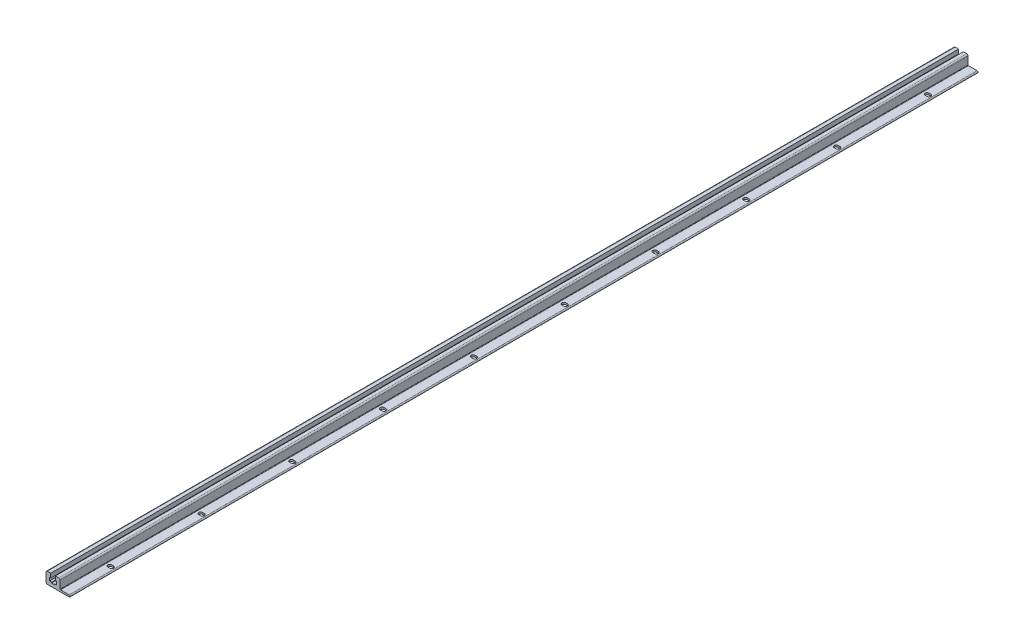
ISO-10303-21;
HEADER;
FILE_DESCRIPTION(('STEP AP214'),'2;1');
FILE_NAME('part.step','',(''),(''),'','','');
FILE_SCHEMA(('AUTOMOTIVE_DESIGN { 1 0 10303 214 1 1 1 1 }'));
ENDSEC;
DATA;
#1=APPLICATION_CONTEXT('core data for automotive mechanical design processes');
#2=APPLICATION_PROTOCOL_DEFINITION('international standard','automotive_design',2000,#1);
#3=PRODUCT_CONTEXT('',#1,'mechanical');
#4=PRODUCT('Part','Part','',(#3));
#5=PRODUCT_RELATED_PRODUCT_CATEGORY('part','',(#4));
#6=PRODUCT_DEFINITION_FORMATION('','',#4);
#7=PRODUCT_DEFINITION_CONTEXT('part definition',#1,'design');
#8=PRODUCT_DEFINITION('design','',#6,#7);
#9=PRODUCT_DEFINITION_SHAPE('','',#8);
#10=(LENGTH_UNIT() NAMED_UNIT(*) SI_UNIT(.MILLI.,.METRE.));
#11=(NAMED_UNIT(*) PLANE_ANGLE_UNIT() SI_UNIT($,.RADIAN.));
#12=(NAMED_UNIT(*) SI_UNIT($,.STERADIAN.) SOLID_ANGLE_UNIT());
#13=UNCERTAINTY_MEASURE_WITH_UNIT(LENGTH_MEASURE(1.E-05),#10,'distance_accuracy_value','');
#14=(GEOMETRIC_REPRESENTATION_CONTEXT(3) GLOBAL_UNCERTAINTY_ASSIGNED_CONTEXT((#13)) GLOBAL_UNIT_ASSIGNED_CONTEXT((#10,
#11,#12)) REPRESENTATION_CONTEXT('',''));
#15=CARTESIAN_POINT('',(0.,0.,0.));
#16=DIRECTION('',(0.,0.,1.));
#17=DIRECTION('',(1.,0.,0.));
#18=AXIS2_PLACEMENT_3D('',#15,#16,#17);
#19=CARTESIAN_POINT('',(-7.7499999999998,8.80000000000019,0.));
#20=DIRECTION('',(0.,1.,0.));
#21=DIRECTION('',(0.,0.,1.));
#22=AXIS2_PLACEMENT_3D('',#19,#20,#21);
#23=PLANE('',#22);
#24=DIRECTION('',(0.,0.,1.));
#25=VECTOR('',#24,1.);
#26=CARTESIAN_POINT('',(-3.2,8.80000000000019,0.));
#27=LINE('',#26,#25);
#28=CARTESIAN_POINT('',(-3.2,8.80000000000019,0.));
#29=VERTEX_POINT('',#28);
#30=CARTESIAN_POINT('',(-3.2,8.80000000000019,2000.));
#31=VERTEX_POINT('',#30);
#32=EDGE_CURVE('E432',#29,#31,#27,.T.);
#33=ORIENTED_EDGE('',*,*,#32,.F.);
#34=DIRECTION('',(-1.,0.,0.));
#35=VECTOR('',#34,1.);
#36=CARTESIAN_POINT('',(-7.7499999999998,8.80000000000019,0.));
#37=LINE('',#36,#35);
#38=CARTESIAN_POINT('',(-7.7499999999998,8.80000000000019,0.));
#39=VERTEX_POINT('',#38);
#40=EDGE_CURVE('E423',#29,#39,#37,.T.);
#41=ORIENTED_EDGE('',*,*,#40,.T.);
#42=DIRECTION('',(0.,0.,1.));
#43=VECTOR('',#42,1.);
#44=CARTESIAN_POINT('',(-7.7499999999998,8.80000000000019,0.));
#45=LINE('',#44,#43);
#46=CARTESIAN_POINT('',(-7.7499999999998,8.80000000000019,2000.));
#47=VERTEX_POINT('',#46);
#48=EDGE_CURVE('E878',#39,#47,#45,.T.);
#49=ORIENTED_EDGE('',*,*,#48,.T.);
#50=DIRECTION('',(-1.,0.,0.));
#51=VECTOR('',#50,1.);
#52=CARTESIAN_POINT('',(-7.7499999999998,8.80000000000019,2000.));
#53=LINE('',#52,#51);
#54=EDGE_CURVE('E783',#31,#47,#53,.T.);
#55=ORIENTED_EDGE('',*,*,#54,.F.);
#56=EDGE_LOOP('',(#33,#41,#49,#55));
#57=FACE_BOUND('',#56,.T.);
#58=ADVANCED_FACE('F14',(#57),#23,.T.);
#59=CARTESIAN_POINT('',(35.5,2.,0.));
#60=DIRECTION('',(0.,0.,1.));
#61=DIRECTION('',(1.,0.,0.));
#62=AXIS2_PLACEMENT_3D('',#59,#60,#61);
#63=CYLINDRICAL_SURFACE('',#62,2.);
#64=CARTESIAN_POINT('',(35.5,2.,2000.));
#65=DIRECTION('',(0.,0.,1.));
#66=DIRECTION('',(1.,0.,0.));
#67=AXIS2_PLACEMENT_3D('',#64,#65,#66);
#68=CIRCLE('',#67,2.);
#69=CARTESIAN_POINT('',(35.5,0.,2000.));
#70=VERTEX_POINT('',#69);
#71=CARTESIAN_POINT('',(35.5,4.,2000.));
#72=VERTEX_POINT('',#71);
#73=EDGE_CURVE('E750',#70,#72,#68,.T.);
#74=ORIENTED_EDGE('',*,*,#73,.F.);
#75=DIRECTION('',(0.,0.,1.));
#76=VECTOR('',#75,1.);
#77=CARTESIAN_POINT('',(35.5,0.,0.));
#78=LINE('',#77,#76);
#79=CARTESIAN_POINT('',(35.5,0.,0.));
#80=VERTEX_POINT('',#79);
#81=EDGE_CURVE('E9',#80,#70,#78,.T.);
#82=ORIENTED_EDGE('',*,*,#81,.F.);
#83=CARTESIAN_POINT('',(35.5,2.,0.));
#84=DIRECTION('',(0.,0.,1.));
#85=DIRECTION('',(1.,0.,0.));
#86=AXIS2_PLACEMENT_3D('',#83,#84,#85);
#87=CIRCLE('',#86,2.);
#88=CARTESIAN_POINT('',(35.5,4.,0.));
#89=VERTEX_POINT('',#88);
#90=EDGE_CURVE('E811',#80,#89,#87,.T.);
#91=ORIENTED_EDGE('',*,*,#90,.T.);
#92=DIRECTION('',(0.,0.,1.));
#93=VECTOR('',#92,1.);
#94=CARTESIAN_POINT('',(35.5,4.,0.));
#95=LINE('',#94,#93);
#96=EDGE_CURVE('E18',#89,#72,#95,.T.);
#97=ORIENTED_EDGE('',*,*,#96,.T.);
#98=EDGE_LOOP('',(#74,#82,#91,#97));
#99=FACE_BOUND('',#98,.T.);
#100=ADVANCED_FACE('F16',(#99),#63,.T.);
#101=CARTESIAN_POINT('',(-12.5,0.,0.));
#102=DIRECTION('',(0.,-1.,0.));
#103=DIRECTION('',(0.,0.,-1.));
#104=AXIS2_PLACEMENT_3D('',#101,#102,#103);
#105=PLANE('',#104);
#106=CARTESIAN_POINT('',(25.1999999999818,0.,100.));
#107=DIRECTION('',(0.,1.,0.));
#108=DIRECTION('',(0.,0.,1.));
#109=AXIS2_PLACEMENT_3D('',#106,#107,#108);
#110=CIRCLE('',#109,4.25);
#111=CARTESIAN_POINT('',(25.1999999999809,0.,95.75));
#112=VERTEX_POINT('',#111);
#113=CARTESIAN_POINT('',(25.1999999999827,0.,104.25));
#114=VERTEX_POINT('',#113);
#115=EDGE_CURVE('E449',#112,#114,#110,.T.);
#116=ORIENTED_EDGE('',*,*,#115,.T.);
#117=DIRECTION('',(1.,0.,0.));
#118=VECTOR('',#117,1.);
#119=CARTESIAN_POINT('',(29.1999999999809,0.,104.25));
#120=LINE('',#119,#118);
#121=CARTESIAN_POINT('',(29.1999999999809,0.,104.25));
#122=VERTEX_POINT('',#121);
#123=EDGE_CURVE('E452',#114,#122,#120,.T.);
#124=ORIENTED_EDGE('',*,*,#123,.T.);
#125=CARTESIAN_POINT('',(29.1999999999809,0.,100.));
#126=DIRECTION('',(0.,1.,0.));
#127=DIRECTION('',(0.,0.,1.));
#128=AXIS2_PLACEMENT_3D('',#125,#126,#127);
#129=CIRCLE('',#128,4.25);
#130=CARTESIAN_POINT('',(29.1999999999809,0.,95.75));
#131=VERTEX_POINT('',#130);
#132=EDGE_CURVE('E39',#122,#131,#129,.T.);
#133=ORIENTED_EDGE('',*,*,#132,.T.);
#134=DIRECTION('',(-1.,0.,0.));
#135=VECTOR('',#134,1.);
#136=CARTESIAN_POINT('',(29.1999999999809,0.,95.75));
#137=LINE('',#136,#135);
#138=EDGE_CURVE('E456',#131,#112,#137,.T.);
#139=ORIENTED_EDGE('',*,*,#138,.T.);
#140=EDGE_LOOP('',(#116,#124,#133,#139));
#141=FACE_BOUND('',#140,.T.);
#142=CARTESIAN_POINT('',(25.199999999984,0.,300.));
#143=DIRECTION('',(0.,1.,0.));
#144=DIRECTION('',(0.,0.,1.));
#145=AXIS2_PLACEMENT_3D('',#142,#143,#144);
#146=CIRCLE('',#145,4.25);
#147=CARTESIAN_POINT('',(25.199999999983,0.,295.75));
#148=VERTEX_POINT('',#147);
#149=CARTESIAN_POINT('',(25.1999999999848,0.,304.25));
#150=VERTEX_POINT('',#149);
#151=EDGE_CURVE('E479',#148,#150,#146,.T.);
#152=ORIENTED_EDGE('',*,*,#151,.T.);
#153=DIRECTION('',(1.,0.,0.));
#154=VECTOR('',#153,1.);
#155=CARTESIAN_POINT('',(29.199999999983,0.,304.25));
#156=LINE('',#155,#154);
#157=CARTESIAN_POINT('',(29.199999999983,0.,304.25));
#158=VERTEX_POINT('',#157);
#159=EDGE_CURVE('E482',#150,#158,#156,.T.);
#160=ORIENTED_EDGE('',*,*,#159,.T.);
#161=CARTESIAN_POINT('',(29.199999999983,0.,300.));
#162=DIRECTION('',(0.,1.,0.));
#163=DIRECTION('',(0.,0.,1.));
#164=AXIS2_PLACEMENT_3D('',#161,#162,#163);
#165=CIRCLE('',#164,4.25);
#166=CARTESIAN_POINT('',(29.199999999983,0.,295.75));
#167=VERTEX_POINT('',#166);
#168=EDGE_CURVE('E485',#158,#167,#165,.T.);
#169=ORIENTED_EDGE('',*,*,#168,.T.);
#170=DIRECTION('',(-1.,0.,0.));
#171=VECTOR('',#170,1.);
#172=CARTESIAN_POINT('',(29.199999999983,0.,295.75));
#173=LINE('',#172,#171);
#174=EDGE_CURVE('E488',#167,#148,#173,.T.);
#175=ORIENTED_EDGE('',*,*,#174,.T.);
#176=EDGE_LOOP('',(#152,#160,#169,#175));
#177=FACE_BOUND('',#176,.T.);
#178=CARTESIAN_POINT('',(25.199999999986,0.,500.));
#179=DIRECTION('',(0.,1.,0.));
#180=DIRECTION('',(0.,0.,1.));
#181=AXIS2_PLACEMENT_3D('',#178,#179,#180);
#182=CIRCLE('',#181,4.25);
#183=CARTESIAN_POINT('',(25.1999999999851,0.,495.75));
#184=VERTEX_POINT('',#183);
#185=CARTESIAN_POINT('',(25.1999999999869,0.,504.25));
#186=VERTEX_POINT('',#185);
#187=EDGE_CURVE('E511',#184,#186,#182,.T.);
#188=ORIENTED_EDGE('',*,*,#187,.T.);
#189=DIRECTION('',(1.,0.,0.));
#190=VECTOR('',#189,1.);
#191=CARTESIAN_POINT('',(29.1999999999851,0.,504.25));
#192=LINE('',#191,#190);
#193=CARTESIAN_POINT('',(29.1999999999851,0.,504.25));
#194=VERTEX_POINT('',#193);
#195=EDGE_CURVE('E514',#186,#194,#192,.T.);
#196=ORIENTED_EDGE('',*,*,#195,.T.);
#197=CARTESIAN_POINT('',(29.1999999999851,0.,500.));
#198=DIRECTION('',(0.,1.,0.));
#199=DIRECTION('',(0.,0.,1.));
#200=AXIS2_PLACEMENT_3D('',#197,#198,#199);
#201=CIRCLE('',#200,4.25);
#202=CARTESIAN_POINT('',(29.1999999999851,0.,495.75));
#203=VERTEX_POINT('',#202);
#204=EDGE_CURVE('E517',#194,#203,#201,.T.);
#205=ORIENTED_EDGE('',*,*,#204,.T.);
#206=DIRECTION('',(-1.,0.,0.));
#207=VECTOR('',#206,1.);
#208=CARTESIAN_POINT('',(29.1999999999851,0.,495.75));
#209=LINE('',#208,#207);
#210=EDGE_CURVE('E520',#203,#184,#209,.T.);
#211=ORIENTED_EDGE('',*,*,#210,.T.);
#212=EDGE_LOOP('',(#188,#196,#205,#211));
#213=FACE_BOUND('',#212,.T.);
#214=CARTESIAN_POINT('',(25.1999999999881,0.,700.));
#215=DIRECTION('',(0.,1.,0.));
#216=DIRECTION('',(0.,0.,1.));
#217=AXIS2_PLACEMENT_3D('',#214,#215,#216);
#218=CIRCLE('',#217,4.25);
#219=CARTESIAN_POINT('',(25.1999999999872,0.,695.75));
#220=VERTEX_POINT('',#219);
#221=CARTESIAN_POINT('',(25.199999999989,0.,704.25));
#222=VERTEX_POINT('',#221);
#223=EDGE_CURVE('E543',#220,#222,#218,.T.);
#224=ORIENTED_EDGE('',*,*,#223,.T.);
#225=DIRECTION('',(1.,0.,0.));
#226=VECTOR('',#225,1.);
#227=CARTESIAN_POINT('',(29.1999999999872,0.,704.25));
#228=LINE('',#227,#226);
#229=CARTESIAN_POINT('',(29.1999999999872,0.,704.25));
#230=VERTEX_POINT('',#229);
#231=EDGE_CURVE('E546',#222,#230,#228,.T.);
#232=ORIENTED_EDGE('',*,*,#231,.T.);
#233=CARTESIAN_POINT('',(29.1999999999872,0.,700.));
#234=DIRECTION('',(0.,1.,0.));
#235=DIRECTION('',(0.,0.,1.));
#236=AXIS2_PLACEMENT_3D('',#233,#234,#235);
#237=CIRCLE('',#236,4.25);
#238=CARTESIAN_POINT('',(29.1999999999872,0.,695.75));
#239=VERTEX_POINT('',#238);
#240=EDGE_CURVE('E549',#230,#239,#237,.T.);
#241=ORIENTED_EDGE('',*,*,#240,.T.);
#242=DIRECTION('',(-1.,0.,0.));
#243=VECTOR('',#242,1.);
#244=CARTESIAN_POINT('',(29.1999999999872,0.,695.75));
#245=LINE('',#244,#243);
#246=EDGE_CURVE('E552',#239,#220,#245,.T.);
#247=ORIENTED_EDGE('',*,*,#246,.T.);
#248=EDGE_LOOP('',(#224,#232,#241,#247));
#249=FACE_BOUND('',#248,.T.);
#250=CARTESIAN_POINT('',(25.1999999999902,0.,900.));
#251=DIRECTION('',(0.,1.,0.));
#252=DIRECTION('',(0.,0.,1.));
#253=AXIS2_PLACEMENT_3D('',#250,#251,#252);
#254=CIRCLE('',#253,4.25);
#255=CARTESIAN_POINT('',(25.1999999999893,0.,895.75));
#256=VERTEX_POINT('',#255);
#257=CARTESIAN_POINT('',(25.1999999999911,0.,904.25));
#258=VERTEX_POINT('',#257);
#259=EDGE_CURVE('E575',#256,#258,#254,.T.);
#260=ORIENTED_EDGE('',*,*,#259,.T.);
#261=DIRECTION('',(1.,0.,0.));
#262=VECTOR('',#261,1.);
#263=CARTESIAN_POINT('',(29.1999999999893,0.,904.25));
#264=LINE('',#263,#262);
#265=CARTESIAN_POINT('',(29.1999999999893,0.,904.25));
#266=VERTEX_POINT('',#265);
#267=EDGE_CURVE('E578',#258,#266,#264,.T.);
#268=ORIENTED_EDGE('',*,*,#267,.T.);
#269=CARTESIAN_POINT('',(29.1999999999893,0.,900.));
#270=DIRECTION('',(0.,1.,0.));
#271=DIRECTION('',(0.,0.,1.));
#272=AXIS2_PLACEMENT_3D('',#269,#270,#271);
#273=CIRCLE('',#272,4.25);
#274=CARTESIAN_POINT('',(29.1999999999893,0.,895.75));
#275=VERTEX_POINT('',#274);
#276=EDGE_CURVE('E581',#266,#275,#273,.T.);
#277=ORIENTED_EDGE('',*,*,#276,.T.);
#278=DIRECTION('',(-1.,0.,0.));
#279=VECTOR('',#278,1.);
#280=CARTESIAN_POINT('',(29.1999999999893,0.,895.75));
#281=LINE('',#280,#279);
#282=EDGE_CURVE('E584',#275,#256,#281,.T.);
#283=ORIENTED_EDGE('',*,*,#282,.T.);
#284=EDGE_LOOP('',(#260,#268,#277,#283));
#285=FACE_BOUND('',#284,.T.);
#286=CARTESIAN_POINT('',(25.1999999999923,0.,1100.));
#287=DIRECTION('',(0.,1.,0.));
#288=DIRECTION('',(0.,0.,1.));
#289=AXIS2_PLACEMENT_3D('',#286,#287,#288);
#290=CIRCLE('',#289,4.25);
#291=CARTESIAN_POINT('',(25.1999999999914,0.,1095.75));
#292=VERTEX_POINT('',#291);
#293=CARTESIAN_POINT('',(25.1999999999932,0.,1104.25));
#294=VERTEX_POINT('',#293);
#295=EDGE_CURVE('E607',#292,#294,#290,.T.);
#296=ORIENTED_EDGE('',*,*,#295,.T.);
#297=DIRECTION('',(1.,0.,0.));
#298=VECTOR('',#297,1.);
#299=CARTESIAN_POINT('',(29.1999999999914,0.,1104.25));
#300=LINE('',#299,#298);
#301=CARTESIAN_POINT('',(29.1999999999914,0.,1104.25));
#302=VERTEX_POINT('',#301);
#303=EDGE_CURVE('E610',#294,#302,#300,.T.);
#304=ORIENTED_EDGE('',*,*,#303,.T.);
#305=CARTESIAN_POINT('',(29.1999999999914,0.,1100.));
#306=DIRECTION('',(0.,1.,0.));
#307=DIRECTION('',(0.,0.,1.));
#308=AXIS2_PLACEMENT_3D('',#305,#306,#307);
#309=CIRCLE('',#308,4.25);
#310=CARTESIAN_POINT('',(29.1999999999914,0.,1095.75));
#311=VERTEX_POINT('',#310);
#312=EDGE_CURVE('E613',#302,#311,#309,.T.);
#313=ORIENTED_EDGE('',*,*,#312,.T.);
#314=DIRECTION('',(-1.,0.,0.));
#315=VECTOR('',#314,1.);
#316=CARTESIAN_POINT('',(29.1999999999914,0.,1095.75));
#317=LINE('',#316,#315);
#318=EDGE_CURVE('E616',#311,#292,#317,.T.);
#319=ORIENTED_EDGE('',*,*,#318,.T.);
#320=EDGE_LOOP('',(#296,#304,#313,#319));
#321=FACE_BOUND('',#320,.T.);
#322=CARTESIAN_POINT('',(25.1999999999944,0.,1300.));
#323=DIRECTION('',(0.,1.,0.));
#324=DIRECTION('',(0.,0.,1.));
#325=AXIS2_PLACEMENT_3D('',#322,#323,#324);
#326=CIRCLE('',#325,4.25);
#327=CARTESIAN_POINT('',(25.1999999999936,0.,1295.75));
#328=VERTEX_POINT('',#327);
#329=CARTESIAN_POINT('',(25.1999999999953,0.,1304.25));
#330=VERTEX_POINT('',#329);
#331=EDGE_CURVE('E639',#328,#330,#326,.T.);
#332=ORIENTED_EDGE('',*,*,#331,.T.);
#333=DIRECTION('',(1.,0.,0.));
#334=VECTOR('',#333,1.);
#335=CARTESIAN_POINT('',(29.1999999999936,0.,1304.25));
#336=LINE('',#335,#334);
#337=CARTESIAN_POINT('',(29.1999999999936,0.,1304.25));
#338=VERTEX_POINT('',#337);
#339=EDGE_CURVE('E642',#330,#338,#336,.T.);
#340=ORIENTED_EDGE('',*,*,#339,.T.);
#341=CARTESIAN_POINT('',(29.1999999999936,0.,1300.));
#342=DIRECTION('',(0.,1.,0.));
#343=DIRECTION('',(0.,0.,1.));
#344=AXIS2_PLACEMENT_3D('',#341,#342,#343);
#345=CIRCLE('',#344,4.25);
#346=CARTESIAN_POINT('',(29.1999999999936,0.,1295.75));
#347=VERTEX_POINT('',#346);
#348=EDGE_CURVE('E645',#338,#347,#345,.T.);
#349=ORIENTED_EDGE('',*,*,#348,.T.);
#350=DIRECTION('',(-1.,0.,0.));
#351=VECTOR('',#350,1.);
#352=CARTESIAN_POINT('',(29.1999999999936,0.,1295.75));
#353=LINE('',#352,#351);
#354=EDGE_CURVE('E648',#347,#328,#353,.T.);
#355=ORIENTED_EDGE('',*,*,#354,.T.);
#356=EDGE_LOOP('',(#332,#340,#349,#355));
#357=FACE_BOUND('',#356,.T.);
#358=CARTESIAN_POINT('',(25.1999999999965,0.,1500.));
#359=DIRECTION('',(0.,1.,0.));
#360=DIRECTION('',(0.,0.,1.));
#361=AXIS2_PLACEMENT_3D('',#358,#359,#360);
#362=CIRCLE('',#361,4.25);
#363=CARTESIAN_POINT('',(25.1999999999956,0.,1495.75));
#364=VERTEX_POINT('',#363);
#365=CARTESIAN_POINT('',(25.1999999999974,0.,1504.25));
#366=VERTEX_POINT('',#365);
#367=EDGE_CURVE('E671',#364,#366,#362,.T.);
#368=ORIENTED_EDGE('',*,*,#367,.T.);
#369=DIRECTION('',(1.,0.,0.));
#370=VECTOR('',#369,1.);
#371=CARTESIAN_POINT('',(29.1999999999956,0.,1504.25));
#372=LINE('',#371,#370);
#373=CARTESIAN_POINT('',(29.1999999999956,0.,1504.25));
#374=VERTEX_POINT('',#373);
#375=EDGE_CURVE('E674',#366,#374,#372,.T.);
#376=ORIENTED_EDGE('',*,*,#375,.T.);
#377=CARTESIAN_POINT('',(29.1999999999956,0.,1500.));
#378=DIRECTION('',(0.,1.,0.));
#379=DIRECTION('',(0.,0.,1.));
#380=AXIS2_PLACEMENT_3D('',#377,#378,#379);
#381=CIRCLE('',#380,4.25);
#382=CARTESIAN_POINT('',(29.1999999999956,0.,1495.75));
#383=VERTEX_POINT('',#382);
#384=EDGE_CURVE('E677',#374,#383,#381,.T.);
#385=ORIENTED_EDGE('',*,*,#384,.T.);
#386=DIRECTION('',(-1.,0.,0.));
#387=VECTOR('',#386,1.);
#388=CARTESIAN_POINT('',(29.1999999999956,0.,1495.75));
#389=LINE('',#388,#387);
#390=EDGE_CURVE('E680',#383,#364,#389,.T.);
#391=ORIENTED_EDGE('',*,*,#390,.T.);
#392=EDGE_LOOP('',(#368,#376,#385,#391));
#393=FACE_BOUND('',#392,.T.);
#394=CARTESIAN_POINT('',(25.1999999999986,0.,1700.));
#395=DIRECTION('',(0.,1.,0.));
#396=DIRECTION('',(0.,0.,1.));
#397=AXIS2_PLACEMENT_3D('',#394,#395,#396);
#398=CIRCLE('',#397,4.25);
#399=CARTESIAN_POINT('',(25.1999999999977,0.,1695.75));
#400=VERTEX_POINT('',#399);
#401=CARTESIAN_POINT('',(25.1999999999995,0.,1704.25));
#402=VERTEX_POINT('',#401);
#403=EDGE_CURVE('E703',#400,#402,#398,.T.);
#404=ORIENTED_EDGE('',*,*,#403,.T.);
#405=DIRECTION('',(1.,0.,0.));
#406=VECTOR('',#405,1.);
#407=CARTESIAN_POINT('',(29.1999999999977,0.,1704.25));
#408=LINE('',#407,#406);
#409=CARTESIAN_POINT('',(29.1999999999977,0.,1704.25));
#410=VERTEX_POINT('',#409);
#411=EDGE_CURVE('E706',#402,#410,#408,.T.);
#412=ORIENTED_EDGE('',*,*,#411,.T.);
#413=CARTESIAN_POINT('',(29.1999999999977,0.,1700.));
#414=DIRECTION('',(0.,1.,0.));
#415=DIRECTION('',(0.,0.,1.));
#416=AXIS2_PLACEMENT_3D('',#413,#414,#415);
#417=CIRCLE('',#416,4.25);
#418=CARTESIAN_POINT('',(29.1999999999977,0.,1695.75));
#419=VERTEX_POINT('',#418);
#420=EDGE_CURVE('E709',#410,#419,#417,.T.);
#421=ORIENTED_EDGE('',*,*,#420,.T.);
#422=DIRECTION('',(-1.,0.,0.));
#423=VECTOR('',#422,1.);
#424=CARTESIAN_POINT('',(29.1999999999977,0.,1695.75));
#425=LINE('',#424,#423);
#426=EDGE_CURVE('E712',#419,#400,#425,.T.);
#427=ORIENTED_EDGE('',*,*,#426,.T.);
#428=EDGE_LOOP('',(#404,#412,#421,#427));
#429=FACE_BOUND('',#428,.T.);
#430=CARTESIAN_POINT('',(25.2000000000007,0.,1900.));
#431=DIRECTION('',(0.,1.,0.));
#432=DIRECTION('',(0.,0.,1.));
#433=AXIS2_PLACEMENT_3D('',#430,#431,#432);
#434=CIRCLE('',#433,4.25);
#435=CARTESIAN_POINT('',(25.2,0.,1895.75));
#436=VERTEX_POINT('',#435);
#437=CARTESIAN_POINT('',(25.2000000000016,0.,1904.25));
#438=VERTEX_POINT('',#437);
#439=EDGE_CURVE('E735',#436,#438,#434,.T.);
#440=ORIENTED_EDGE('',*,*,#439,.T.);
#441=DIRECTION('',(1.,0.,0.));
#442=VECTOR('',#441,1.);
#443=CARTESIAN_POINT('',(29.2,0.,1904.25));
#444=LINE('',#443,#442);
#445=CARTESIAN_POINT('',(29.2,0.,1904.25));
#446=VERTEX_POINT('',#445);
#447=EDGE_CURVE('E738',#438,#446,#444,.T.);
#448=ORIENTED_EDGE('',*,*,#447,.T.);
#449=CARTESIAN_POINT('',(29.2,0.,1900.));
#450=DIRECTION('',(0.,1.,0.));
#451=DIRECTION('',(0.,0.,1.));
#452=AXIS2_PLACEMENT_3D('',#449,#450,#451);
#453=CIRCLE('',#452,4.25);
#454=CARTESIAN_POINT('',(29.2,0.,1895.75));
#455=VERTEX_POINT('',#454);
#456=EDGE_CURVE('E741',#446,#455,#453,.T.);
#457=ORIENTED_EDGE('',*,*,#456,.T.);
#458=DIRECTION('',(-1.,0.,0.));
#459=VECTOR('',#458,1.);
#460=CARTESIAN_POINT('',(29.2,0.,1895.75));
#461=LINE('',#460,#459);
#462=EDGE_CURVE('E744',#455,#436,#461,.T.);
#463=ORIENTED_EDGE('',*,*,#462,.T.);
#464=EDGE_LOOP('',(#440,#448,#457,#463));
#465=FACE_BOUND('',#464,.T.);
#466=DIRECTION('',(1.,0.,0.));
#467=VECTOR('',#466,1.);
#468=CARTESIAN_POINT('',(-12.5,0.,2000.));
#469=LINE('',#468,#467);
#470=CARTESIAN_POINT('',(-12.5,0.,2000.));
#471=VERTEX_POINT('',#470);
#472=EDGE_CURVE('E808',#471,#70,#469,.T.);
#473=ORIENTED_EDGE('',*,*,#472,.F.);
#474=DIRECTION('',(0.,0.,1.));
#475=VECTOR('',#474,1.);
#476=CARTESIAN_POINT('',(-12.5,0.,0.));
#477=LINE('',#476,#475);
#478=CARTESIAN_POINT('',(-12.5,0.,0.));
#479=VERTEX_POINT('',#478);
#480=EDGE_CURVE('E23',#479,#471,#477,.T.);
#481=ORIENTED_EDGE('',*,*,#480,.F.);
#482=DIRECTION('',(1.,0.,0.));
#483=VECTOR('',#482,1.);
#484=CARTESIAN_POINT('',(-12.5,0.,0.));
#485=LINE('',#484,#483);
#486=EDGE_CURVE('E862',#479,#80,#485,.T.);
#487=ORIENTED_EDGE('',*,*,#486,.T.);
#488=ORIENTED_EDGE('',*,*,#81,.T.);
#489=EDGE_LOOP('',(#473,#481,#487,#488));
#490=FACE_BOUND('',#489,.T.);
#491=ADVANCED_FACE('F908',(#141,#177,#213,#249,#285,#321,#357,#393,#429,#465,#490),#105,.T.);
#492=CARTESIAN_POINT('',(-12.5,3.,0.));
#493=DIRECTION('',(0.,0.,1.));
#494=DIRECTION('',(1.,0.,0.));
#495=AXIS2_PLACEMENT_3D('',#492,#493,#494);
#496=CYLINDRICAL_SURFACE('',#495,3.);
#497=CARTESIAN_POINT('',(-12.5,3.,2000.));
#498=DIRECTION('',(0.,0.,1.));
#499=DIRECTION('',(-1.,0.,0.));
#500=AXIS2_PLACEMENT_3D('',#497,#498,#499);
#501=CIRCLE('',#500,3.);
#502=CARTESIAN_POINT('',(-15.5,3.,2000.));
#503=VERTEX_POINT('',#502);
#504=EDGE_CURVE('E805',#503,#471,#501,.T.);
#505=ORIENTED_EDGE('',*,*,#504,.F.);
#506=DIRECTION('',(0.,0.,1.));
#507=VECTOR('',#506,1.);
#508=CARTESIAN_POINT('',(-15.5,3.,0.));
#509=LINE('',#508,#507);
#510=CARTESIAN_POINT('',(-15.5,3.,0.));
#511=VERTEX_POINT('',#510);
#512=EDGE_CURVE('E866',#511,#503,#509,.T.);
#513=ORIENTED_EDGE('',*,*,#512,.F.);
#514=CARTESIAN_POINT('',(-12.5,3.,0.));
#515=DIRECTION('',(0.,0.,1.));
#516=DIRECTION('',(-1.,0.,0.));
#517=AXIS2_PLACEMENT_3D('',#514,#515,#516);
#518=CIRCLE('',#517,3.);
#519=EDGE_CURVE('E859',#511,#479,#518,.T.);
#520=ORIENTED_EDGE('',*,*,#519,.T.);
#521=ORIENTED_EDGE('',*,*,#480,.T.);
#522=EDGE_LOOP('',(#505,#513,#520,#521));
#523=FACE_BOUND('',#522,.T.);
#524=ADVANCED_FACE('F972',(#523),#496,.T.);
#525=CARTESIAN_POINT('',(-15.5,22.0000000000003,0.));
#526=DIRECTION('',(-1.,0.,0.));
#527=DIRECTION('',(0.,0.,1.));
#528=AXIS2_PLACEMENT_3D('',#525,#526,#527);
#529=PLANE('',#528);
#530=DIRECTION('',(0.,-1.,0.));
#531=VECTOR('',#530,1.);
#532=CARTESIAN_POINT('',(-15.5,22.0000000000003,2000.));
#533=LINE('',#532,#531);
#534=CARTESIAN_POINT('',(-15.5,22.0000000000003,2000.));
#535=VERTEX_POINT('',#534);
#536=EDGE_CURVE('E802',#535,#503,#533,.T.);
#537=ORIENTED_EDGE('',*,*,#536,.F.);
#538=DIRECTION('',(0.,0.,1.));
#539=VECTOR('',#538,1.);
#540=CARTESIAN_POINT('',(-15.5,22.0000000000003,0.));
#541=LINE('',#540,#539);
#542=CARTESIAN_POINT('',(-15.5,22.0000000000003,0.));
#543=VERTEX_POINT('',#542);
#544=EDGE_CURVE('E868',#543,#535,#541,.T.);
#545=ORIENTED_EDGE('',*,*,#544,.F.);
#546=DIRECTION('',(0.,-1.,0.));
#547=VECTOR('',#546,1.);
#548=CARTESIAN_POINT('',(-15.5,22.0000000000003,0.));
#549=LINE('',#548,#547);
#550=EDGE_CURVE('E856',#543,#511,#549,.T.);
#551=ORIENTED_EDGE('',*,*,#550,.T.);
#552=ORIENTED_EDGE('',*,*,#512,.T.);
#553=EDGE_LOOP('',(#537,#545,#551,#552));
#554=FACE_BOUND('',#553,.T.);
#555=ADVANCED_FACE('F970',(#554),#529,.T.);
#556=CARTESIAN_POINT('',(-12.5,22.0000000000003,0.));
#557=DIRECTION('',(0.,0.,1.));
#558=DIRECTION('',(1.,0.,0.));
#559=AXIS2_PLACEMENT_3D('',#556,#557,#558);
#560=CYLINDRICAL_SURFACE('',#559,3.);
#561=CARTESIAN_POINT('',(-12.5,22.0000000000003,2000.));
#562=DIRECTION('',(0.,0.,1.));
#563=DIRECTION('',(-1.,0.,0.));
#564=AXIS2_PLACEMENT_3D('',#561,#562,#563);
#565=CIRCLE('',#564,3.);
#566=CARTESIAN_POINT('',(-12.5,25.0000000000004,2000.));
#567=VERTEX_POINT('',#566);
#568=EDGE_CURVE('E799',#567,#535,#565,.T.);
#569=ORIENTED_EDGE('',*,*,#568,.F.);
#570=DIRECTION('',(0.,0.,1.));
#571=VECTOR('',#570,1.);
#572=CARTESIAN_POINT('',(-12.5,25.0000000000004,0.));
#573=LINE('',#572,#571);
#574=CARTESIAN_POINT('',(-12.5,25.0000000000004,0.));
#575=VERTEX_POINT('',#574);
#576=EDGE_CURVE('E870',#575,#567,#573,.T.);
#577=ORIENTED_EDGE('',*,*,#576,.F.);
#578=CARTESIAN_POINT('',(-12.5,22.0000000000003,0.));
#579=DIRECTION('',(0.,0.,1.));
#580=DIRECTION('',(-1.,0.,0.));
#581=AXIS2_PLACEMENT_3D('',#578,#579,#580);
#582=CIRCLE('',#581,3.);
#583=EDGE_CURVE('E853',#575,#543,#582,.T.);
#584=ORIENTED_EDGE('',*,*,#583,.T.);
#585=ORIENTED_EDGE('',*,*,#544,.T.);
#586=EDGE_LOOP('',(#569,#577,#584,#585));
#587=FACE_BOUND('',#586,.T.);
#588=ADVANCED_FACE('F966',(#587),#560,.T.);
#589=CARTESIAN_POINT('',(-12.5,25.0000000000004,0.));
#590=DIRECTION('',(0.,1.,0.));
#591=DIRECTION('',(0.,0.,1.));
#592=AXIS2_PLACEMENT_3D('',#589,#590,#591);
#593=PLANE('',#592);
#594=DIRECTION('',(-1.,0.,0.));
#595=VECTOR('',#594,1.);
#596=CARTESIAN_POINT('',(-12.5,25.0000000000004,2000.));
#597=LINE('',#596,#595);
#598=CARTESIAN_POINT('',(-5.19999999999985,25.0000000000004,2000.));
#599=VERTEX_POINT('',#598);
#600=EDGE_CURVE('E796',#599,#567,#597,.T.);
#601=ORIENTED_EDGE('',*,*,#600,.F.);
#602=DIRECTION('',(0.,0.,1.));
#603=VECTOR('',#602,1.);
#604=CARTESIAN_POINT('',(-5.19999999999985,25.0000000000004,0.));
#605=LINE('',#604,#603);
#606=CARTESIAN_POINT('',(-5.19999999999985,25.0000000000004,0.));
#607=VERTEX_POINT('',#606);
#608=EDGE_CURVE('E872',#607,#599,#605,.T.);
#609=ORIENTED_EDGE('',*,*,#608,.F.);
#610=DIRECTION('',(-1.,0.,0.));
#611=VECTOR('',#610,1.);
#612=CARTESIAN_POINT('',(-12.5,25.0000000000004,0.));
#613=LINE('',#612,#611);
#614=EDGE_CURVE('E850',#607,#575,#613,.T.);
#615=ORIENTED_EDGE('',*,*,#614,.T.);
#616=ORIENTED_EDGE('',*,*,#576,.T.);
#617=EDGE_LOOP('',(#601,#609,#615,#616));
#618=FACE_BOUND('',#617,.T.);
#619=ADVANCED_FACE('F962',(#618),#593,.T.);
#620=CARTESIAN_POINT('',(-5.19999999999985,25.0000000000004,0.));
#621=DIRECTION('',(1.,0.,0.));
#622=DIRECTION('',(0.,0.,-1.));
#623=AXIS2_PLACEMENT_3D('',#620,#621,#622);
#624=PLANE('',#623);
#625=DIRECTION('',(0.,1.,0.));
#626=VECTOR('',#625,1.);
#627=CARTESIAN_POINT('',(-5.19999999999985,25.0000000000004,2000.));
#628=LINE('',#627,#626);
#629=CARTESIAN_POINT('',(-5.19999999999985,15.9000000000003,2000.));
#630=VERTEX_POINT('',#629);
#631=EDGE_CURVE('E793',#630,#599,#628,.T.);
#632=ORIENTED_EDGE('',*,*,#631,.F.);
#633=DIRECTION('',(0.,0.,1.));
#634=VECTOR('',#633,1.);
#635=CARTESIAN_POINT('',(-5.19999999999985,15.9000000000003,0.));
#636=LINE('',#635,#634);
#637=CARTESIAN_POINT('',(-5.19999999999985,15.9000000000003,0.));
#638=VERTEX_POINT('',#637);
#639=EDGE_CURVE('E874',#638,#630,#636,.T.);
#640=ORIENTED_EDGE('',*,*,#639,.F.);
#641=DIRECTION('',(0.,1.,0.));
#642=VECTOR('',#641,1.);
#643=CARTESIAN_POINT('',(-5.19999999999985,25.0000000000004,0.));
#644=LINE('',#643,#642);
#645=EDGE_CURVE('E847',#638,#607,#644,.T.);
#646=ORIENTED_EDGE('',*,*,#645,.T.);
#647=ORIENTED_EDGE('',*,*,#608,.T.);
#648=EDGE_LOOP('',(#632,#640,#646,#647));
#649=FACE_BOUND('',#648,.T.);
#650=ADVANCED_FACE('F958',(#649),#624,.T.);
#651=CARTESIAN_POINT('',(-5.19999999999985,15.9000000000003,0.));
#652=DIRECTION('',(0.,-1.,0.));
#653=DIRECTION('',(0.,0.,-1.));
#654=AXIS2_PLACEMENT_3D('',#651,#652,#653);
#655=PLANE('',#654);
#656=DIRECTION('',(1.,0.,0.));
#657=VECTOR('',#656,1.);
#658=CARTESIAN_POINT('',(-5.19999999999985,15.9000000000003,2000.));
#659=LINE('',#658,#657);
#660=CARTESIAN_POINT('',(-7.7499999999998,15.9000000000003,2000.));
#661=VERTEX_POINT('',#660);
#662=EDGE_CURVE('E790',#661,#630,#659,.T.);
#663=ORIENTED_EDGE('',*,*,#662,.F.);
#664=DIRECTION('',(0.,0.,1.));
#665=VECTOR('',#664,1.);
#666=CARTESIAN_POINT('',(-7.7499999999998,15.9000000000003,0.));
#667=LINE('',#666,#665);
#668=CARTESIAN_POINT('',(-7.7499999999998,15.9000000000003,0.));
#669=VERTEX_POINT('',#668);
#670=EDGE_CURVE('E876',#669,#661,#667,.T.);
#671=ORIENTED_EDGE('',*,*,#670,.F.);
#672=DIRECTION('',(1.,0.,0.));
#673=VECTOR('',#672,1.);
#674=CARTESIAN_POINT('',(-5.19999999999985,15.9000000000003,0.));
#675=LINE('',#674,#673);
#676=EDGE_CURVE('E844',#669,#638,#675,.T.);
#677=ORIENTED_EDGE('',*,*,#676,.T.);
#678=ORIENTED_EDGE('',*,*,#639,.T.);
#679=EDGE_LOOP('',(#663,#671,#677,#678));
#680=FACE_BOUND('',#679,.T.);
#681=ADVANCED_FACE('F954',(#680),#655,.T.);
#682=CARTESIAN_POINT('',(-7.7499999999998,15.9000000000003,0.));
#683=DIRECTION('',(1.,0.,0.));
#684=DIRECTION('',(0.,0.,-1.));
#685=AXIS2_PLACEMENT_3D('',#682,#683,#684);
#686=PLANE('',#685);
#687=DIRECTION('',(0.,1.,0.));
#688=VECTOR('',#687,1.);
#689=CARTESIAN_POINT('',(-7.7499999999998,15.9000000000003,2000.));
#690=LINE('',#689,#688);
#691=EDGE_CURVE('E787',#47,#661,#690,.T.);
#692=ORIENTED_EDGE('',*,*,#691,.F.);
#693=ORIENTED_EDGE('',*,*,#48,.F.);
#694=DIRECTION('',(0.,1.,0.));
#695=VECTOR('',#694,1.);
#696=CARTESIAN_POINT('',(-7.7499999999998,15.9000000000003,0.));
#697=LINE('',#696,#695);
#698=EDGE_CURVE('E841',#39,#669,#697,.T.);
#699=ORIENTED_EDGE('',*,*,#698,.T.);
#700=ORIENTED_EDGE('',*,*,#670,.T.);
#701=EDGE_LOOP('',(#692,#693,#699,#700));
#702=FACE_BOUND('',#701,.T.);
#703=ADVANCED_FACE('F950',(#702),#686,.T.);
#704=DIRECTION('',(0.,0.,1.));
#705=VECTOR('',#704,1.);
#706=CARTESIAN_POINT('',(3.2,8.80000000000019,0.));
#707=LINE('',#706,#705);
#708=CARTESIAN_POINT('',(3.2,8.80000000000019,0.));
#709=VERTEX_POINT('',#708);
#710=CARTESIAN_POINT('',(3.2,8.80000000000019,2000.));
#711=VERTEX_POINT('',#710);
#712=EDGE_CURVE('E435',#709,#711,#707,.T.);
#713=ORIENTED_EDGE('',*,*,#712,.T.);
#714=CARTESIAN_POINT('',(7.7500000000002,8.80000000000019,2000.));
#715=VERTEX_POINT('',#714);
#716=EDGE_CURVE('E784',#715,#711,#53,.T.);
#717=ORIENTED_EDGE('',*,*,#716,.F.);
#718=DIRECTION('',(0.,0.,1.));
#719=VECTOR('',#718,1.);
#720=CARTESIAN_POINT('',(7.7500000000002,8.80000000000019,0.));
#721=LINE('',#720,#719);
#722=CARTESIAN_POINT('',(7.7500000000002,8.80000000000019,0.));
#723=VERTEX_POINT('',#722);
#724=EDGE_CURVE('E881',#723,#715,#721,.T.);
#725=ORIENTED_EDGE('',*,*,#724,.F.);
#726=EDGE_CURVE('E838',#723,#709,#37,.T.);
#727=ORIENTED_EDGE('',*,*,#726,.T.);
#728=EDGE_LOOP('',(#713,#717,#725,#727));
#729=FACE_BOUND('',#728,.T.);
#730=ADVANCED_FACE('F941',(#729),#23,.T.);
#731=CARTESIAN_POINT('',(7.7500000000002,15.9000000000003,0.));
#732=DIRECTION('',(-1.,0.,0.));
#733=DIRECTION('',(0.,0.,1.));
#734=AXIS2_PLACEMENT_3D('',#731,#732,#733);
#735=PLANE('',#734);
#736=DIRECTION('',(0.,-1.,0.));
#737=VECTOR('',#736,1.);
#738=CARTESIAN_POINT('',(7.7500000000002,15.9000000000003,2000.));
#739=LINE('',#738,#737);
#740=CARTESIAN_POINT('',(7.7500000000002,15.9000000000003,2000.));
#741=VERTEX_POINT('',#740);
#742=EDGE_CURVE('E780',#741,#715,#739,.T.);
#743=ORIENTED_EDGE('',*,*,#742,.F.);
#744=DIRECTION('',(0.,0.,1.));
#745=VECTOR('',#744,1.);
#746=CARTESIAN_POINT('',(7.7500000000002,15.9000000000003,0.));
#747=LINE('',#746,#745);
#748=CARTESIAN_POINT('',(7.7500000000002,15.9000000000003,0.));
#749=VERTEX_POINT('',#748);
#750=EDGE_CURVE('E883',#749,#741,#747,.T.);
#751=ORIENTED_EDGE('',*,*,#750,.F.);
#752=DIRECTION('',(0.,-1.,0.));
#753=VECTOR('',#752,1.);
#754=CARTESIAN_POINT('',(7.7500000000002,15.9000000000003,0.));
#755=LINE('',#754,#753);
#756=EDGE_CURVE('E835',#749,#723,#755,.T.);
#757=ORIENTED_EDGE('',*,*,#756,.T.);
#758=ORIENTED_EDGE('',*,*,#724,.T.);
#759=EDGE_LOOP('',(#743,#751,#757,#758));
#760=FACE_BOUND('',#759,.T.);
#761=ADVANCED_FACE('F937',(#760),#735,.T.);
#762=CARTESIAN_POINT('',(5.20000000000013,15.9000000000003,0.));
#763=DIRECTION('',(0.,-1.,0.));
#764=DIRECTION('',(0.,0.,-1.));
#765=AXIS2_PLACEMENT_3D('',#762,#763,#764);
#766=PLANE('',#765);
#767=DIRECTION('',(1.,0.,0.));
#768=VECTOR('',#767,1.);
#769=CARTESIAN_POINT('',(5.20000000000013,15.9000000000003,2000.));
#770=LINE('',#769,#768);
#771=CARTESIAN_POINT('',(5.20000000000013,15.9000000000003,2000.));
#772=VERTEX_POINT('',#771);
#773=EDGE_CURVE('E777',#772,#741,#770,.T.);
#774=ORIENTED_EDGE('',*,*,#773,.F.);
#775=DIRECTION('',(0.,0.,1.));
#776=VECTOR('',#775,1.);
#777=CARTESIAN_POINT('',(5.20000000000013,15.9000000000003,0.));
#778=LINE('',#777,#776);
#779=CARTESIAN_POINT('',(5.20000000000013,15.9000000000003,0.));
#780=VERTEX_POINT('',#779);
#781=EDGE_CURVE('E885',#780,#772,#778,.T.);
#782=ORIENTED_EDGE('',*,*,#781,.F.);
#783=DIRECTION('',(1.,0.,0.));
#784=VECTOR('',#783,1.);
#785=CARTESIAN_POINT('',(5.20000000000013,15.9000000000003,0.));
#786=LINE('',#785,#784);
#787=EDGE_CURVE('E832',#780,#749,#786,.T.);
#788=ORIENTED_EDGE('',*,*,#787,.T.);
#789=ORIENTED_EDGE('',*,*,#750,.T.);
#790=EDGE_LOOP('',(#774,#782,#788,#789));
#791=FACE_BOUND('',#790,.T.);
#792=ADVANCED_FACE('F933',(#791),#766,.T.);
#793=CARTESIAN_POINT('',(5.20000000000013,25.,0.));
#794=DIRECTION('',(-1.,0.,0.));
#795=DIRECTION('',(0.,0.,1.));
#796=AXIS2_PLACEMENT_3D('',#793,#794,#795);
#797=PLANE('',#796);
#798=DIRECTION('',(0.,-1.,0.));
#799=VECTOR('',#798,1.);
#800=CARTESIAN_POINT('',(5.20000000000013,25.,2000.));
#801=LINE('',#800,#799);
#802=CARTESIAN_POINT('',(5.20000000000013,25.,2000.));
#803=VERTEX_POINT('',#802);
#804=EDGE_CURVE('E774',#803,#772,#801,.T.);
#805=ORIENTED_EDGE('',*,*,#804,.F.);
#806=DIRECTION('',(0.,0.,1.));
#807=VECTOR('',#806,1.);
#808=CARTESIAN_POINT('',(5.20000000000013,25.,0.));
#809=LINE('',#808,#807);
#810=CARTESIAN_POINT('',(5.20000000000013,25.,0.));
#811=VERTEX_POINT('',#810);
#812=EDGE_CURVE('E887',#811,#803,#809,.T.);
#813=ORIENTED_EDGE('',*,*,#812,.F.);
#814=DIRECTION('',(0.,-1.,0.));
#815=VECTOR('',#814,1.);
#816=CARTESIAN_POINT('',(5.20000000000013,25.,0.));
#817=LINE('',#816,#815);
#818=EDGE_CURVE('E829',#811,#780,#817,.T.);
#819=ORIENTED_EDGE('',*,*,#818,.T.);
#820=ORIENTED_EDGE('',*,*,#781,.T.);
#821=EDGE_LOOP('',(#805,#813,#819,#820));
#822=FACE_BOUND('',#821,.T.);
#823=ADVANCED_FACE('F929',(#822),#797,.T.);
#824=CARTESIAN_POINT('',(12.4999999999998,25.,0.));
#825=DIRECTION('',(0.,1.,0.));
#826=DIRECTION('',(0.,0.,1.));
#827=AXIS2_PLACEMENT_3D('',#824,#825,#826);
#828=PLANE('',#827);
#829=DIRECTION('',(-1.,0.,0.));
#830=VECTOR('',#829,1.);
#831=CARTESIAN_POINT('',(12.4999999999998,25.,2000.));
#832=LINE('',#831,#830);
#833=CARTESIAN_POINT('',(12.4999999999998,25.,2000.));
#834=VERTEX_POINT('',#833);
#835=EDGE_CURVE('E771',#834,#803,#832,.T.);
#836=ORIENTED_EDGE('',*,*,#835,.F.);
#837=DIRECTION('',(0.,0.,1.));
#838=VECTOR('',#837,1.);
#839=CARTESIAN_POINT('',(12.4999999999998,25.,0.));
#840=LINE('',#839,#838);
#841=CARTESIAN_POINT('',(12.4999999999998,25.,0.));
#842=VERTEX_POINT('',#841);
#843=EDGE_CURVE('E889',#842,#834,#840,.T.);
#844=ORIENTED_EDGE('',*,*,#843,.F.);
#845=DIRECTION('',(-1.,0.,0.));
#846=VECTOR('',#845,1.);
#847=CARTESIAN_POINT('',(12.4999999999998,25.,0.));
#848=LINE('',#847,#846);
#849=EDGE_CURVE('E826',#842,#811,#848,.T.);
#850=ORIENTED_EDGE('',*,*,#849,.T.);
#851=ORIENTED_EDGE('',*,*,#812,.T.);
#852=EDGE_LOOP('',(#836,#844,#850,#851));
#853=FACE_BOUND('',#852,.T.);
#854=ADVANCED_FACE('F925',(#853),#828,.T.);
#855=CARTESIAN_POINT('',(12.4999999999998,22.,0.));
#856=DIRECTION('',(0.,0.,1.));
#857=DIRECTION('',(1.,0.,0.));
#858=AXIS2_PLACEMENT_3D('',#855,#856,#857);
#859=CYLINDRICAL_SURFACE('',#858,3.);
#860=CARTESIAN_POINT('',(12.4999999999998,22.,2000.));
#861=DIRECTION('',(0.,0.,1.));
#862=DIRECTION('',(-1.,0.,0.));
#863=AXIS2_PLACEMENT_3D('',#860,#861,#862);
#864=CIRCLE('',#863,3.);
#865=CARTESIAN_POINT('',(15.5,22.,2000.));
#866=VERTEX_POINT('',#865);
#867=EDGE_CURVE('E768',#866,#834,#864,.T.);
#868=ORIENTED_EDGE('',*,*,#867,.F.);
#869=DIRECTION('',(0.,0.,1.));
#870=VECTOR('',#869,1.);
#871=CARTESIAN_POINT('',(15.5,22.,0.));
#872=LINE('',#871,#870);
#873=CARTESIAN_POINT('',(15.5,22.,0.));
#874=VERTEX_POINT('',#873);
#875=EDGE_CURVE('E891',#874,#866,#872,.T.);
#876=ORIENTED_EDGE('',*,*,#875,.F.);
#877=CARTESIAN_POINT('',(12.4999999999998,22.,0.));
#878=DIRECTION('',(0.,0.,1.));
#879=DIRECTION('',(-1.,0.,0.));
#880=AXIS2_PLACEMENT_3D('',#877,#878,#879);
#881=CIRCLE('',#880,3.);
#882=EDGE_CURVE('E823',#874,#842,#881,.T.);
#883=ORIENTED_EDGE('',*,*,#882,.T.);
#884=ORIENTED_EDGE('',*,*,#843,.T.);
#885=EDGE_LOOP('',(#868,#876,#883,#884));
#886=FACE_BOUND('',#885,.T.);
#887=ADVANCED_FACE('F921',(#886),#859,.T.);
#888=CARTESIAN_POINT('',(15.5,22.,0.));
#889=DIRECTION('',(1.,0.,0.));
#890=DIRECTION('',(0.,1.,0.));
#891=AXIS2_PLACEMENT_3D('',#888,#889,#890);
#892=PLANE('',#891);
#893=DIRECTION('',(0.,1.,0.));
#894=VECTOR('',#893,1.);
#895=CARTESIAN_POINT('',(15.5,22.,2000.));
#896=LINE('',#895,#894);
#897=CARTESIAN_POINT('',(15.5,5.,2000.));
#898=VERTEX_POINT('',#897);
#899=EDGE_CURVE('E765',#898,#866,#896,.T.);
#900=ORIENTED_EDGE('',*,*,#899,.F.);
#901=DIRECTION('',(0.,0.,1.));
#902=VECTOR('',#901,1.);
#903=CARTESIAN_POINT('',(15.5,5.,0.));
#904=LINE('',#903,#902);
#905=CARTESIAN_POINT('',(15.5,5.,0.));
#906=VERTEX_POINT('',#905);
#907=EDGE_CURVE('E893',#906,#898,#904,.T.);
#908=ORIENTED_EDGE('',*,*,#907,.F.);
#909=DIRECTION('',(0.,1.,0.));
#910=VECTOR('',#909,1.);
#911=CARTESIAN_POINT('',(15.5,22.,0.));
#912=LINE('',#911,#910);
#913=EDGE_CURVE('E820',#906,#874,#912,.T.);
#914=ORIENTED_EDGE('',*,*,#913,.T.);
#915=ORIENTED_EDGE('',*,*,#875,.T.);
#916=EDGE_LOOP('',(#900,#908,#914,#915));
#917=FACE_BOUND('',#916,.T.);
#918=ADVANCED_FACE('F919',(#917),#892,.T.);
#919=CARTESIAN_POINT('',(16.5,5.,0.));
#920=DIRECTION('',(0.,0.,1.));
#921=DIRECTION('',(1.,0.,0.));
#922=AXIS2_PLACEMENT_3D('',#919,#920,#921);
#923=CYLINDRICAL_SURFACE('',#922,1.);
#924=CARTESIAN_POINT('',(16.5,5.,2000.));
#925=DIRECTION('',(0.,0.,-1.));
#926=DIRECTION('',(-1.,0.,0.));
#927=AXIS2_PLACEMENT_3D('',#924,#925,#926);
#928=CIRCLE('',#927,1.);
#929=CARTESIAN_POINT('',(16.5,4.,2000.));
#930=VERTEX_POINT('',#929);
#931=EDGE_CURVE('E762',#930,#898,#928,.T.);
#932=ORIENTED_EDGE('',*,*,#931,.F.);
#933=DIRECTION('',(0.,0.,1.));
#934=VECTOR('',#933,1.);
#935=CARTESIAN_POINT('',(16.5,4.,0.));
#936=LINE('',#935,#934);
#937=CARTESIAN_POINT('',(16.5,4.,0.));
#938=VERTEX_POINT('',#937);
#939=EDGE_CURVE('E894',#938,#930,#936,.T.);
#940=ORIENTED_EDGE('',*,*,#939,.F.);
#941=CARTESIAN_POINT('',(16.5,5.,0.));
#942=DIRECTION('',(0.,0.,-1.));
#943=DIRECTION('',(-1.,0.,0.));
#944=AXIS2_PLACEMENT_3D('',#941,#942,#943);
#945=CIRCLE('',#944,1.);
#946=EDGE_CURVE('E817',#938,#906,#945,.T.);
#947=ORIENTED_EDGE('',*,*,#946,.T.);
#948=ORIENTED_EDGE('',*,*,#907,.T.);
#949=EDGE_LOOP('',(#932,#940,#947,#948));
#950=FACE_BOUND('',#949,.T.);
#951=ADVANCED_FACE('F915',(#950),#923,.F.);
#952=CARTESIAN_POINT('',(16.5,4.,0.));
#953=DIRECTION('',(0.,1.,0.));
#954=DIRECTION('',(0.,0.,1.));
#955=AXIS2_PLACEMENT_3D('',#952,#953,#954);
#956=PLANE('',#955);
#957=CARTESIAN_POINT('',(25.1999999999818,4.,100.));
#958=DIRECTION('',(0.,1.,0.));
#959=DIRECTION('',(0.,0.,1.));
#960=AXIS2_PLACEMENT_3D('',#957,#958,#959);
#961=CIRCLE('',#960,4.25);
#962=CARTESIAN_POINT('',(25.1999999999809,4.,95.75));
#963=VERTEX_POINT('',#962);
#964=CARTESIAN_POINT('',(25.1999999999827,4.,104.25));
#965=VERTEX_POINT('',#964);
#966=EDGE_CURVE('E434',#963,#965,#961,.T.);
#967=ORIENTED_EDGE('',*,*,#966,.F.);
#968=DIRECTION('',(-1.,0.,0.));
#969=VECTOR('',#968,1.);
#970=CARTESIAN_POINT('',(29.1999999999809,4.,95.75));
#971=LINE('',#970,#969);
#972=CARTESIAN_POINT('',(29.1999999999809,4.,95.75));
#973=VERTEX_POINT('',#972);
#974=EDGE_CURVE('E446',#973,#963,#971,.T.);
#975=ORIENTED_EDGE('',*,*,#974,.F.);
#976=CARTESIAN_POINT('',(29.1999999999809,4.,100.));
#977=DIRECTION('',(0.,1.,0.));
#978=DIRECTION('',(0.,0.,1.));
#979=AXIS2_PLACEMENT_3D('',#976,#977,#978);
#980=CIRCLE('',#979,4.25);
#981=CARTESIAN_POINT('',(29.1999999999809,4.,104.25));
#982=VERTEX_POINT('',#981);
#983=EDGE_CURVE('E443',#982,#973,#980,.T.);
#984=ORIENTED_EDGE('',*,*,#983,.F.);
#985=DIRECTION('',(1.,0.,0.));
#986=VECTOR('',#985,1.);
#987=CARTESIAN_POINT('',(29.1999999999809,4.,104.25));
#988=LINE('',#987,#986);
#989=EDGE_CURVE('E440',#965,#982,#988,.T.);
#990=ORIENTED_EDGE('',*,*,#989,.F.);
#991=EDGE_LOOP('',(#967,#975,#984,#990));
#992=FACE_BOUND('',#991,.T.);
#993=CARTESIAN_POINT('',(25.199999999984,4.,300.));
#994=DIRECTION('',(0.,1.,0.));
#995=DIRECTION('',(0.,0.,1.));
#996=AXIS2_PLACEMENT_3D('',#993,#994,#995);
#997=CIRCLE('',#996,4.25);
#998=CARTESIAN_POINT('',(25.199999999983,4.,295.75));
#999=VERTEX_POINT('',#998);
#1000=CARTESIAN_POINT('',(25.1999999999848,4.,304.25));
#1001=VERTEX_POINT('',#1000);
#1002=EDGE_CURVE('E462',#999,#1001,#997,.T.);
#1003=ORIENTED_EDGE('',*,*,#1002,.F.);
#1004=DIRECTION('',(-1.,0.,0.));
#1005=VECTOR('',#1004,1.);
#1006=CARTESIAN_POINT('',(29.199999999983,4.,295.75));
#1007=LINE('',#1006,#1005);
#1008=CARTESIAN_POINT('',(29.199999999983,4.,295.75));
#1009=VERTEX_POINT('',#1008);
#1010=EDGE_CURVE('E476',#1009,#999,#1007,.T.);
#1011=ORIENTED_EDGE('',*,*,#1010,.F.);
#1012=CARTESIAN_POINT('',(29.199999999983,4.,300.));
#1013=DIRECTION('',(0.,1.,0.));
#1014=DIRECTION('',(0.,0.,1.));
#1015=AXIS2_PLACEMENT_3D('',#1012,#1013,#1014);
#1016=CIRCLE('',#1015,4.25);
#1017=CARTESIAN_POINT('',(29.199999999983,4.,304.25));
#1018=VERTEX_POINT('',#1017);
#1019=EDGE_CURVE('E473',#1018,#1009,#1016,.T.);
#1020=ORIENTED_EDGE('',*,*,#1019,.F.);
#1021=DIRECTION('',(1.,0.,0.));
#1022=VECTOR('',#1021,1.);
#1023=CARTESIAN_POINT('',(29.199999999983,4.,304.25));
#1024=LINE('',#1023,#1022);
#1025=EDGE_CURVE('E470',#1001,#1018,#1024,.T.);
#1026=ORIENTED_EDGE('',*,*,#1025,.F.);
#1027=EDGE_LOOP('',(#1003,#1011,#1020,#1026));
#1028=FACE_BOUND('',#1027,.T.);
#1029=CARTESIAN_POINT('',(25.199999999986,4.,500.));
#1030=DIRECTION('',(0.,1.,0.));
#1031=DIRECTION('',(0.,0.,1.));
#1032=AXIS2_PLACEMENT_3D('',#1029,#1030,#1031);
#1033=CIRCLE('',#1032,4.25);
#1034=CARTESIAN_POINT('',(25.1999999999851,4.,495.75));
#1035=VERTEX_POINT('',#1034);
#1036=CARTESIAN_POINT('',(25.1999999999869,4.,504.25));
#1037=VERTEX_POINT('',#1036);
#1038=EDGE_CURVE('E494',#1035,#1037,#1033,.T.);
#1039=ORIENTED_EDGE('',*,*,#1038,.F.);
#1040=DIRECTION('',(-1.,0.,0.));
#1041=VECTOR('',#1040,1.);
#1042=CARTESIAN_POINT('',(29.1999999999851,4.,495.75));
#1043=LINE('',#1042,#1041);
#1044=CARTESIAN_POINT('',(29.1999999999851,4.,495.75));
#1045=VERTEX_POINT('',#1044);
#1046=EDGE_CURVE('E508',#1045,#1035,#1043,.T.);
#1047=ORIENTED_EDGE('',*,*,#1046,.F.);
#1048=CARTESIAN_POINT('',(29.1999999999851,4.,500.));
#1049=DIRECTION('',(0.,1.,0.));
#1050=DIRECTION('',(0.,0.,1.));
#1051=AXIS2_PLACEMENT_3D('',#1048,#1049,#1050);
#1052=CIRCLE('',#1051,4.25);
#1053=CARTESIAN_POINT('',(29.1999999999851,4.,504.25));
#1054=VERTEX_POINT('',#1053);
#1055=EDGE_CURVE('E505',#1054,#1045,#1052,.T.);
#1056=ORIENTED_EDGE('',*,*,#1055,.F.);
#1057=DIRECTION('',(1.,0.,0.));
#1058=VECTOR('',#1057,1.);
#1059=CARTESIAN_POINT('',(29.1999999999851,4.,504.25));
#1060=LINE('',#1059,#1058);
#1061=EDGE_CURVE('E502',#1037,#1054,#1060,.T.);
#1062=ORIENTED_EDGE('',*,*,#1061,.F.);
#1063=EDGE_LOOP('',(#1039,#1047,#1056,#1062));
#1064=FACE_BOUND('',#1063,.T.);
#1065=CARTESIAN_POINT('',(25.1999999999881,4.,700.));
#1066=DIRECTION('',(0.,1.,0.));
#1067=DIRECTION('',(0.,0.,1.));
#1068=AXIS2_PLACEMENT_3D('',#1065,#1066,#1067);
#1069=CIRCLE('',#1068,4.25);
#1070=CARTESIAN_POINT('',(25.1999999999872,4.,695.75));
#1071=VERTEX_POINT('',#1070);
#1072=CARTESIAN_POINT('',(25.199999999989,4.,704.25));
#1073=VERTEX_POINT('',#1072);
#1074=EDGE_CURVE('E526',#1071,#1073,#1069,.T.);
#1075=ORIENTED_EDGE('',*,*,#1074,.F.);
#1076=DIRECTION('',(-1.,0.,0.));
#1077=VECTOR('',#1076,1.);
#1078=CARTESIAN_POINT('',(29.1999999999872,4.,695.75));
#1079=LINE('',#1078,#1077);
#1080=CARTESIAN_POINT('',(29.1999999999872,4.,695.75));
#1081=VERTEX_POINT('',#1080);
#1082=EDGE_CURVE('E540',#1081,#1071,#1079,.T.);
#1083=ORIENTED_EDGE('',*,*,#1082,.F.);
#1084=CARTESIAN_POINT('',(29.1999999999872,4.,700.));
#1085=DIRECTION('',(0.,1.,0.));
#1086=DIRECTION('',(0.,0.,1.));
#1087=AXIS2_PLACEMENT_3D('',#1084,#1085,#1086);
#1088=CIRCLE('',#1087,4.25);
#1089=CARTESIAN_POINT('',(29.1999999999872,4.,704.25));
#1090=VERTEX_POINT('',#1089);
#1091=EDGE_CURVE('E537',#1090,#1081,#1088,.T.);
#1092=ORIENTED_EDGE('',*,*,#1091,.F.);
#1093=DIRECTION('',(1.,0.,0.));
#1094=VECTOR('',#1093,1.);
#1095=CARTESIAN_POINT('',(29.1999999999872,4.,704.25));
#1096=LINE('',#1095,#1094);
#1097=EDGE_CURVE('E534',#1073,#1090,#1096,.T.);
#1098=ORIENTED_EDGE('',*,*,#1097,.F.);
#1099=EDGE_LOOP('',(#1075,#1083,#1092,#1098));
#1100=FACE_BOUND('',#1099,.T.);
#1101=CARTESIAN_POINT('',(25.1999999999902,4.,900.));
#1102=DIRECTION('',(0.,1.,0.));
#1103=DIRECTION('',(0.,0.,1.));
#1104=AXIS2_PLACEMENT_3D('',#1101,#1102,#1103);
#1105=CIRCLE('',#1104,4.25);
#1106=CARTESIAN_POINT('',(25.1999999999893,4.,895.75));
#1107=VERTEX_POINT('',#1106);
#1108=CARTESIAN_POINT('',(25.1999999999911,4.,904.25));
#1109=VERTEX_POINT('',#1108);
#1110=EDGE_CURVE('E558',#1107,#1109,#1105,.T.);
#1111=ORIENTED_EDGE('',*,*,#1110,.F.);
#1112=DIRECTION('',(-1.,0.,0.));
#1113=VECTOR('',#1112,1.);
#1114=CARTESIAN_POINT('',(29.1999999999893,4.,895.75));
#1115=LINE('',#1114,#1113);
#1116=CARTESIAN_POINT('',(29.1999999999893,4.,895.75));
#1117=VERTEX_POINT('',#1116);
#1118=EDGE_CURVE('E572',#1117,#1107,#1115,.T.);
#1119=ORIENTED_EDGE('',*,*,#1118,.F.);
#1120=CARTESIAN_POINT('',(29.1999999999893,4.,900.));
#1121=DIRECTION('',(0.,1.,0.));
#1122=DIRECTION('',(0.,0.,1.));
#1123=AXIS2_PLACEMENT_3D('',#1120,#1121,#1122);
#1124=CIRCLE('',#1123,4.25);
#1125=CARTESIAN_POINT('',(29.1999999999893,4.,904.25));
#1126=VERTEX_POINT('',#1125);
#1127=EDGE_CURVE('E569',#1126,#1117,#1124,.T.);
#1128=ORIENTED_EDGE('',*,*,#1127,.F.);
#1129=DIRECTION('',(1.,0.,0.));
#1130=VECTOR('',#1129,1.);
#1131=CARTESIAN_POINT('',(29.1999999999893,4.,904.25));
#1132=LINE('',#1131,#1130);
#1133=EDGE_CURVE('E566',#1109,#1126,#1132,.T.);
#1134=ORIENTED_EDGE('',*,*,#1133,.F.);
#1135=EDGE_LOOP('',(#1111,#1119,#1128,#1134));
#1136=FACE_BOUND('',#1135,.T.);
#1137=CARTESIAN_POINT('',(25.1999999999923,4.,1100.));
#1138=DIRECTION('',(0.,1.,0.));
#1139=DIRECTION('',(0.,0.,1.));
#1140=AXIS2_PLACEMENT_3D('',#1137,#1138,#1139);
#1141=CIRCLE('',#1140,4.25);
#1142=CARTESIAN_POINT('',(25.1999999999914,4.,1095.75));
#1143=VERTEX_POINT('',#1142);
#1144=CARTESIAN_POINT('',(25.1999999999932,4.,1104.25));
#1145=VERTEX_POINT('',#1144);
#1146=EDGE_CURVE('E590',#1143,#1145,#1141,.T.);
#1147=ORIENTED_EDGE('',*,*,#1146,.F.);
#1148=DIRECTION('',(-1.,0.,0.));
#1149=VECTOR('',#1148,1.);
#1150=CARTESIAN_POINT('',(29.1999999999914,4.,1095.75));
#1151=LINE('',#1150,#1149);
#1152=CARTESIAN_POINT('',(29.1999999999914,4.,1095.75));
#1153=VERTEX_POINT('',#1152);
#1154=EDGE_CURVE('E604',#1153,#1143,#1151,.T.);
#1155=ORIENTED_EDGE('',*,*,#1154,.F.);
#1156=CARTESIAN_POINT('',(29.1999999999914,4.,1100.));
#1157=DIRECTION('',(0.,1.,0.));
#1158=DIRECTION('',(0.,0.,1.));
#1159=AXIS2_PLACEMENT_3D('',#1156,#1157,#1158);
#1160=CIRCLE('',#1159,4.25);
#1161=CARTESIAN_POINT('',(29.1999999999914,4.,1104.25));
#1162=VERTEX_POINT('',#1161);
#1163=EDGE_CURVE('E601',#1162,#1153,#1160,.T.);
#1164=ORIENTED_EDGE('',*,*,#1163,.F.);
#1165=DIRECTION('',(1.,0.,0.));
#1166=VECTOR('',#1165,1.);
#1167=CARTESIAN_POINT('',(29.1999999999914,4.,1104.25));
#1168=LINE('',#1167,#1166);
#1169=EDGE_CURVE('E598',#1145,#1162,#1168,.T.);
#1170=ORIENTED_EDGE('',*,*,#1169,.F.);
#1171=EDGE_LOOP('',(#1147,#1155,#1164,#1170));
#1172=FACE_BOUND('',#1171,.T.);
#1173=CARTESIAN_POINT('',(25.1999999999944,4.,1300.));
#1174=DIRECTION('',(0.,1.,0.));
#1175=DIRECTION('',(0.,0.,1.));
#1176=AXIS2_PLACEMENT_3D('',#1173,#1174,#1175);
#1177=CIRCLE('',#1176,4.25);
#1178=CARTESIAN_POINT('',(25.1999999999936,4.,1295.75));
#1179=VERTEX_POINT('',#1178);
#1180=CARTESIAN_POINT('',(25.1999999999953,4.,1304.25));
#1181=VERTEX_POINT('',#1180);
#1182=EDGE_CURVE('E622',#1179,#1181,#1177,.T.);
#1183=ORIENTED_EDGE('',*,*,#1182,.F.);
#1184=DIRECTION('',(-1.,0.,0.));
#1185=VECTOR('',#1184,1.);
#1186=CARTESIAN_POINT('',(29.1999999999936,4.,1295.75));
#1187=LINE('',#1186,#1185);
#1188=CARTESIAN_POINT('',(29.1999999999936,4.,1295.75));
#1189=VERTEX_POINT('',#1188);
#1190=EDGE_CURVE('E636',#1189,#1179,#1187,.T.);
#1191=ORIENTED_EDGE('',*,*,#1190,.F.);
#1192=CARTESIAN_POINT('',(29.1999999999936,4.,1300.));
#1193=DIRECTION('',(0.,1.,0.));
#1194=DIRECTION('',(0.,0.,1.));
#1195=AXIS2_PLACEMENT_3D('',#1192,#1193,#1194);
#1196=CIRCLE('',#1195,4.25);
#1197=CARTESIAN_POINT('',(29.1999999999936,4.,1304.25));
#1198=VERTEX_POINT('',#1197);
#1199=EDGE_CURVE('E633',#1198,#1189,#1196,.T.);
#1200=ORIENTED_EDGE('',*,*,#1199,.F.);
#1201=DIRECTION('',(1.,0.,0.));
#1202=VECTOR('',#1201,1.);
#1203=CARTESIAN_POINT('',(29.1999999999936,4.,1304.25));
#1204=LINE('',#1203,#1202);
#1205=EDGE_CURVE('E630',#1181,#1198,#1204,.T.);
#1206=ORIENTED_EDGE('',*,*,#1205,.F.);
#1207=EDGE_LOOP('',(#1183,#1191,#1200,#1206));
#1208=FACE_BOUND('',#1207,.T.);
#1209=CARTESIAN_POINT('',(25.1999999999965,4.,1500.));
#1210=DIRECTION('',(0.,1.,0.));
#1211=DIRECTION('',(0.,0.,1.));
#1212=AXIS2_PLACEMENT_3D('',#1209,#1210,#1211);
#1213=CIRCLE('',#1212,4.25);
#1214=CARTESIAN_POINT('',(25.1999999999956,4.,1495.75));
#1215=VERTEX_POINT('',#1214);
#1216=CARTESIAN_POINT('',(25.1999999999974,4.,1504.25));
#1217=VERTEX_POINT('',#1216);
#1218=EDGE_CURVE('E654',#1215,#1217,#1213,.T.);
#1219=ORIENTED_EDGE('',*,*,#1218,.F.);
#1220=DIRECTION('',(-1.,0.,0.));
#1221=VECTOR('',#1220,1.);
#1222=CARTESIAN_POINT('',(29.1999999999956,4.,1495.75));
#1223=LINE('',#1222,#1221);
#1224=CARTESIAN_POINT('',(29.1999999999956,4.,1495.75));
#1225=VERTEX_POINT('',#1224);
#1226=EDGE_CURVE('E668',#1225,#1215,#1223,.T.);
#1227=ORIENTED_EDGE('',*,*,#1226,.F.);
#1228=CARTESIAN_POINT('',(29.1999999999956,4.,1500.));
#1229=DIRECTION('',(0.,1.,0.));
#1230=DIRECTION('',(0.,0.,1.));
#1231=AXIS2_PLACEMENT_3D('',#1228,#1229,#1230);
#1232=CIRCLE('',#1231,4.25);
#1233=CARTESIAN_POINT('',(29.1999999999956,4.,1504.25));
#1234=VERTEX_POINT('',#1233);
#1235=EDGE_CURVE('E665',#1234,#1225,#1232,.T.);
#1236=ORIENTED_EDGE('',*,*,#1235,.F.);
#1237=DIRECTION('',(1.,0.,0.));
#1238=VECTOR('',#1237,1.);
#1239=CARTESIAN_POINT('',(29.1999999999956,4.,1504.25));
#1240=LINE('',#1239,#1238);
#1241=EDGE_CURVE('E662',#1217,#1234,#1240,.T.);
#1242=ORIENTED_EDGE('',*,*,#1241,.F.);
#1243=EDGE_LOOP('',(#1219,#1227,#1236,#1242));
#1244=FACE_BOUND('',#1243,.T.);
#1245=CARTESIAN_POINT('',(25.1999999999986,4.,1700.));
#1246=DIRECTION('',(0.,1.,0.));
#1247=DIRECTION('',(0.,0.,1.));
#1248=AXIS2_PLACEMENT_3D('',#1245,#1246,#1247);
#1249=CIRCLE('',#1248,4.25);
#1250=CARTESIAN_POINT('',(25.1999999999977,4.,1695.75));
#1251=VERTEX_POINT('',#1250);
#1252=CARTESIAN_POINT('',(25.1999999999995,4.,1704.25));
#1253=VERTEX_POINT('',#1252);
#1254=EDGE_CURVE('E686',#1251,#1253,#1249,.T.);
#1255=ORIENTED_EDGE('',*,*,#1254,.F.);
#1256=DIRECTION('',(-1.,0.,0.));
#1257=VECTOR('',#1256,1.);
#1258=CARTESIAN_POINT('',(29.1999999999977,4.,1695.75));
#1259=LINE('',#1258,#1257);
#1260=CARTESIAN_POINT('',(29.1999999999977,4.,1695.75));
#1261=VERTEX_POINT('',#1260);
#1262=EDGE_CURVE('E700',#1261,#1251,#1259,.T.);
#1263=ORIENTED_EDGE('',*,*,#1262,.F.);
#1264=CARTESIAN_POINT('',(29.1999999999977,4.,1700.));
#1265=DIRECTION('',(0.,1.,0.));
#1266=DIRECTION('',(0.,0.,1.));
#1267=AXIS2_PLACEMENT_3D('',#1264,#1265,#1266);
#1268=CIRCLE('',#1267,4.25);
#1269=CARTESIAN_POINT('',(29.1999999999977,4.,1704.25));
#1270=VERTEX_POINT('',#1269);
#1271=EDGE_CURVE('E697',#1270,#1261,#1268,.T.);
#1272=ORIENTED_EDGE('',*,*,#1271,.F.);
#1273=DIRECTION('',(1.,0.,0.));
#1274=VECTOR('',#1273,1.);
#1275=CARTESIAN_POINT('',(29.1999999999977,4.,1704.25));
#1276=LINE('',#1275,#1274);
#1277=EDGE_CURVE('E694',#1253,#1270,#1276,.T.);
#1278=ORIENTED_EDGE('',*,*,#1277,.F.);
#1279=EDGE_LOOP('',(#1255,#1263,#1272,#1278));
#1280=FACE_BOUND('',#1279,.T.);
#1281=CARTESIAN_POINT('',(25.2000000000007,4.,1900.));
#1282=DIRECTION('',(0.,1.,0.));
#1283=DIRECTION('',(0.,0.,1.));
#1284=AXIS2_PLACEMENT_3D('',#1281,#1282,#1283);
#1285=CIRCLE('',#1284,4.25);
#1286=CARTESIAN_POINT('',(25.2,4.,1895.75));
#1287=VERTEX_POINT('',#1286);
#1288=CARTESIAN_POINT('',(25.2000000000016,4.,1904.25));
#1289=VERTEX_POINT('',#1288);
#1290=EDGE_CURVE('E718',#1287,#1289,#1285,.T.);
#1291=ORIENTED_EDGE('',*,*,#1290,.F.);
#1292=DIRECTION('',(-1.,0.,0.));
#1293=VECTOR('',#1292,1.);
#1294=CARTESIAN_POINT('',(29.2,4.,1895.75));
#1295=LINE('',#1294,#1293);
#1296=CARTESIAN_POINT('',(29.2,4.,1895.75));
#1297=VERTEX_POINT('',#1296);
#1298=EDGE_CURVE('E732',#1297,#1287,#1295,.T.);
#1299=ORIENTED_EDGE('',*,*,#1298,.F.);
#1300=CARTESIAN_POINT('',(29.2,4.,1900.));
#1301=DIRECTION('',(0.,1.,0.));
#1302=DIRECTION('',(0.,0.,1.));
#1303=AXIS2_PLACEMENT_3D('',#1300,#1301,#1302);
#1304=CIRCLE('',#1303,4.25);
#1305=CARTESIAN_POINT('',(29.2,4.,1904.25));
#1306=VERTEX_POINT('',#1305);
#1307=EDGE_CURVE('E729',#1306,#1297,#1304,.T.);
#1308=ORIENTED_EDGE('',*,*,#1307,.F.);
#1309=DIRECTION('',(1.,0.,0.));
#1310=VECTOR('',#1309,1.);
#1311=CARTESIAN_POINT('',(29.2,4.,1904.25));
#1312=LINE('',#1311,#1310);
#1313=EDGE_CURVE('E726',#1289,#1306,#1312,.T.);
#1314=ORIENTED_EDGE('',*,*,#1313,.F.);
#1315=EDGE_LOOP('',(#1291,#1299,#1308,#1314));
#1316=FACE_BOUND('',#1315,.T.);
#1317=DIRECTION('',(-1.,0.,0.));
#1318=VECTOR('',#1317,1.);
#1319=CARTESIAN_POINT('',(16.5,4.,2000.));
#1320=LINE('',#1319,#1318);
#1321=EDGE_CURVE('E759',#72,#930,#1320,.T.);
#1322=ORIENTED_EDGE('',*,*,#1321,.F.);
#1323=ORIENTED_EDGE('',*,*,#96,.F.);
#1324=DIRECTION('',(-1.,0.,0.));
#1325=VECTOR('',#1324,1.);
#1326=CARTESIAN_POINT('',(16.5,4.,0.));
#1327=LINE('',#1326,#1325);
#1328=EDGE_CURVE('E814',#89,#938,#1327,.T.);
#1329=ORIENTED_EDGE('',*,*,#1328,.T.);
#1330=ORIENTED_EDGE('',*,*,#939,.T.);
#1331=EDGE_LOOP('',(#1322,#1323,#1329,#1330));
#1332=FACE_BOUND('',#1331,.T.);
#1333=ADVANCED_FACE('F902',(#992,#1028,#1064,#1100,#1136,#1172,#1208,#1244,#1280,#1316,#1332),
#956,.T.);
#1334=CARTESIAN_POINT('',(35.5,2.,0.));
#1335=DIRECTION('',(0.,0.,1.));
#1336=DIRECTION('',(1.,0.,0.));
#1337=AXIS2_PLACEMENT_3D('',#1334,#1335,#1336);
#1338=PLANE('',#1337);
#1339=ORIENTED_EDGE('',*,*,#40,.F.);
#1340=DIRECTION('',(0.,-1.,0.));
#1341=VECTOR('',#1340,1.);
#1342=CARTESIAN_POINT('',(-3.2,8.80000000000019,0.));
#1343=LINE('',#1342,#1341);
#1344=CARTESIAN_POINT('',(-3.2,7.30000000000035,0.));
#1345=VERTEX_POINT('',#1344);
#1346=EDGE_CURVE('E405',#29,#1345,#1343,.T.);
#1347=ORIENTED_EDGE('',*,*,#1346,.T.);
#1348=DIRECTION('',(1.,0.,0.));
#1349=VECTOR('',#1348,1.);
#1350=CARTESIAN_POINT('',(-3.2,7.30000000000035,0.));
#1351=LINE('',#1350,#1349);
#1352=CARTESIAN_POINT('',(3.2,7.30000000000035,0.));
#1353=VERTEX_POINT('',#1352);
#1354=EDGE_CURVE('E414',#1345,#1353,#1351,.T.);
#1355=ORIENTED_EDGE('',*,*,#1354,.T.);
#1356=DIRECTION('',(0.,1.,0.));
#1357=VECTOR('',#1356,1.);
#1358=CARTESIAN_POINT('',(3.2,8.80000000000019,0.));
#1359=LINE('',#1358,#1357);
#1360=EDGE_CURVE('E411',#1353,#709,#1359,.T.);
#1361=ORIENTED_EDGE('',*,*,#1360,.T.);
#1362=ORIENTED_EDGE('',*,*,#726,.F.);
#1363=ORIENTED_EDGE('',*,*,#756,.F.);
#1364=ORIENTED_EDGE('',*,*,#787,.F.);
#1365=ORIENTED_EDGE('',*,*,#818,.F.);
#1366=ORIENTED_EDGE('',*,*,#849,.F.);
#1367=ORIENTED_EDGE('',*,*,#882,.F.);
#1368=ORIENTED_EDGE('',*,*,#913,.F.);
#1369=ORIENTED_EDGE('',*,*,#946,.F.);
#1370=ORIENTED_EDGE('',*,*,#1328,.F.);
#1371=ORIENTED_EDGE('',*,*,#90,.F.);
#1372=ORIENTED_EDGE('',*,*,#486,.F.);
#1373=ORIENTED_EDGE('',*,*,#519,.F.);
#1374=ORIENTED_EDGE('',*,*,#550,.F.);
#1375=ORIENTED_EDGE('',*,*,#583,.F.);
#1376=ORIENTED_EDGE('',*,*,#614,.F.);
#1377=ORIENTED_EDGE('',*,*,#645,.F.);
#1378=ORIENTED_EDGE('',*,*,#676,.F.);
#1379=ORIENTED_EDGE('',*,*,#698,.F.);
#1380=EDGE_LOOP('',(#1339,#1347,#1355,#1361,#1362,#1363,#1364,#1365,#1366,#1367,#1368,#1369,
#1370,#1371,#1372,#1373,#1374,#1375,#1376,#1377,#1378,#1379));
#1381=FACE_BOUND('',#1380,.T.);
#1382=ADVANCED_FACE('F421',(#1381),#1338,.F.);
#1383=CARTESIAN_POINT('',(35.5,2.,2000.));
#1384=DIRECTION('',(0.,0.,1.));
#1385=DIRECTION('',(1.,0.,0.));
#1386=AXIS2_PLACEMENT_3D('',#1383,#1384,#1385);
#1387=PLANE('',#1386);
#1388=DIRECTION('',(0.,-1.,0.));
#1389=VECTOR('',#1388,1.);
#1390=CARTESIAN_POINT('',(-3.2,8.80000000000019,2000.));
#1391=LINE('',#1390,#1389);
#1392=CARTESIAN_POINT('',(-3.2,7.30000000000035,2000.));
#1393=VERTEX_POINT('',#1392);
#1394=EDGE_CURVE('E31',#31,#1393,#1391,.T.);
#1395=ORIENTED_EDGE('',*,*,#1394,.F.);
#1396=ORIENTED_EDGE('',*,*,#54,.T.);
#1397=ORIENTED_EDGE('',*,*,#691,.T.);
#1398=ORIENTED_EDGE('',*,*,#662,.T.);
#1399=ORIENTED_EDGE('',*,*,#631,.T.);
#1400=ORIENTED_EDGE('',*,*,#600,.T.);
#1401=ORIENTED_EDGE('',*,*,#568,.T.);
#1402=ORIENTED_EDGE('',*,*,#536,.T.);
#1403=ORIENTED_EDGE('',*,*,#504,.T.);
#1404=ORIENTED_EDGE('',*,*,#472,.T.);
#1405=ORIENTED_EDGE('',*,*,#73,.T.);
#1406=ORIENTED_EDGE('',*,*,#1321,.T.);
#1407=ORIENTED_EDGE('',*,*,#931,.T.);
#1408=ORIENTED_EDGE('',*,*,#899,.T.);
#1409=ORIENTED_EDGE('',*,*,#867,.T.);
#1410=ORIENTED_EDGE('',*,*,#835,.T.);
#1411=ORIENTED_EDGE('',*,*,#804,.T.);
#1412=ORIENTED_EDGE('',*,*,#773,.T.);
#1413=ORIENTED_EDGE('',*,*,#742,.T.);
#1414=ORIENTED_EDGE('',*,*,#716,.T.);
#1415=DIRECTION('',(0.,1.,0.));
#1416=VECTOR('',#1415,1.);
#1417=CARTESIAN_POINT('',(3.2,8.80000000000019,2000.));
#1418=LINE('',#1417,#1416);
#1419=CARTESIAN_POINT('',(3.2,7.30000000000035,2000.));
#1420=VERTEX_POINT('',#1419);
#1421=EDGE_CURVE('E424',#1420,#711,#1418,.T.);
#1422=ORIENTED_EDGE('',*,*,#1421,.F.);
#1423=DIRECTION('',(1.,0.,0.));
#1424=VECTOR('',#1423,1.);
#1425=CARTESIAN_POINT('',(-3.2,7.30000000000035,2000.));
#1426=LINE('',#1425,#1424);
#1427=EDGE_CURVE('E426',#1393,#1420,#1426,.T.);
#1428=ORIENTED_EDGE('',*,*,#1427,.F.);
#1429=EDGE_LOOP('',(#1395,#1396,#1397,#1398,#1399,#1400,#1401,#1402,#1403,#1404,#1405,#1406,
#1407,#1408,#1409,#1410,#1411,#1412,#1413,#1414,#1422,#1428));
#1430=FACE_BOUND('',#1429,.T.);
#1431=ADVANCED_FACE('F904',(#1430),#1387,.T.);
#1432=CARTESIAN_POINT('',(25.2000000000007,0.,1900.));
#1433=DIRECTION('',(0.,1.,0.));
#1434=DIRECTION('',(0.,0.,1.));
#1435=AXIS2_PLACEMENT_3D('',#1432,#1433,#1434);
#1436=CYLINDRICAL_SURFACE('',#1435,4.25);
#1437=ORIENTED_EDGE('',*,*,#1290,.T.);
#1438=DIRECTION('',(0.,1.,0.));
#1439=VECTOR('',#1438,1.);
#1440=CARTESIAN_POINT('',(25.2000000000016,0.,1904.25));
#1441=LINE('',#1440,#1439);
#1442=EDGE_CURVE('E747',#438,#1289,#1441,.T.);
#1443=ORIENTED_EDGE('',*,*,#1442,.F.);
#1444=ORIENTED_EDGE('',*,*,#439,.F.);
#1445=DIRECTION('',(0.,1.,0.));
#1446=VECTOR('',#1445,1.);
#1447=CARTESIAN_POINT('',(25.2,0.,1895.75));
#1448=LINE('',#1447,#1446);
#1449=EDGE_CURVE('E748',#436,#1287,#1448,.T.);
#1450=ORIENTED_EDGE('',*,*,#1449,.T.);
#1451=EDGE_LOOP('',(#1437,#1443,#1444,#1450));
#1452=FACE_BOUND('',#1451,.T.);
#1453=ADVANCED_FACE('F1137',(#1452),#1436,.F.);
#1454=CARTESIAN_POINT('',(29.2,0.,1895.75));
#1455=DIRECTION('',(0.,0.,-1.));
#1456=DIRECTION('',(-1.,0.,0.));
#1457=AXIS2_PLACEMENT_3D('',#1454,#1455,#1456);
#1458=PLANE('',#1457);
#1459=ORIENTED_EDGE('',*,*,#1298,.T.);
#1460=ORIENTED_EDGE('',*,*,#1449,.F.);
#1461=ORIENTED_EDGE('',*,*,#462,.F.);
#1462=DIRECTION('',(0.,1.,0.));
#1463=VECTOR('',#1462,1.);
#1464=CARTESIAN_POINT('',(29.2,0.,1895.75));
#1465=LINE('',#1464,#1463);
#1466=EDGE_CURVE('E751',#455,#1297,#1465,.T.);
#1467=ORIENTED_EDGE('',*,*,#1466,.T.);
#1468=EDGE_LOOP('',(#1459,#1460,#1461,#1467));
#1469=FACE_BOUND('',#1468,.T.);
#1470=ADVANCED_FACE('F1145',(#1469),#1458,.F.);
#1471=CARTESIAN_POINT('',(29.2,0.,1900.));
#1472=DIRECTION('',(0.,1.,0.));
#1473=DIRECTION('',(0.,0.,1.));
#1474=AXIS2_PLACEMENT_3D('',#1471,#1472,#1473);
#1475=CYLINDRICAL_SURFACE('',#1474,4.25);
#1476=ORIENTED_EDGE('',*,*,#1307,.T.);
#1477=ORIENTED_EDGE('',*,*,#1466,.F.);
#1478=ORIENTED_EDGE('',*,*,#456,.F.);
#1479=DIRECTION('',(0.,1.,0.));
#1480=VECTOR('',#1479,1.);
#1481=CARTESIAN_POINT('',(29.2,0.,1904.25));
#1482=LINE('',#1481,#1480);
#1483=EDGE_CURVE('E753',#446,#1306,#1482,.T.);
#1484=ORIENTED_EDGE('',*,*,#1483,.T.);
#1485=EDGE_LOOP('',(#1476,#1477,#1478,#1484));
#1486=FACE_BOUND('',#1485,.T.);
#1487=ADVANCED_FACE('F1154',(#1486),#1475,.F.);
#1488=CARTESIAN_POINT('',(29.2,0.,1904.25));
#1489=DIRECTION('',(0.,0.,1.));
#1490=DIRECTION('',(1.,0.,0.));
#1491=AXIS2_PLACEMENT_3D('',#1488,#1489,#1490);
#1492=PLANE('',#1491);
#1493=ORIENTED_EDGE('',*,*,#1313,.T.);
#1494=ORIENTED_EDGE('',*,*,#1483,.F.);
#1495=ORIENTED_EDGE('',*,*,#447,.F.);
#1496=ORIENTED_EDGE('',*,*,#1442,.T.);
#1497=EDGE_LOOP('',(#1493,#1494,#1495,#1496));
#1498=FACE_BOUND('',#1497,.T.);
#1499=ADVANCED_FACE('F1163',(#1498),#1492,.F.);
#1500=CARTESIAN_POINT('',(25.1999999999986,0.,1700.));
#1501=DIRECTION('',(0.,1.,0.));
#1502=DIRECTION('',(0.,0.,1.));
#1503=AXIS2_PLACEMENT_3D('',#1500,#1501,#1502);
#1504=CYLINDRICAL_SURFACE('',#1503,4.25);
#1505=ORIENTED_EDGE('',*,*,#1254,.T.);
#1506=DIRECTION('',(0.,1.,0.));
#1507=VECTOR('',#1506,1.);
#1508=CARTESIAN_POINT('',(25.1999999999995,0.,1704.25));
#1509=LINE('',#1508,#1507);
#1510=EDGE_CURVE('E715',#402,#1253,#1509,.T.);
#1511=ORIENTED_EDGE('',*,*,#1510,.F.);
#1512=ORIENTED_EDGE('',*,*,#403,.F.);
#1513=DIRECTION('',(0.,1.,0.));
#1514=VECTOR('',#1513,1.);
#1515=CARTESIAN_POINT('',(25.1999999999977,0.,1695.75));
#1516=LINE('',#1515,#1514);
#1517=EDGE_CURVE('E716',#400,#1251,#1516,.T.);
#1518=ORIENTED_EDGE('',*,*,#1517,.T.);
#1519=EDGE_LOOP('',(#1505,#1511,#1512,#1518));
#1520=FACE_BOUND('',#1519,.T.);
#1521=ADVANCED_FACE('F1172',(#1520),#1504,.F.);
#1522=CARTESIAN_POINT('',(29.1999999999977,0.,1695.75));
#1523=DIRECTION('',(0.,0.,-1.));
#1524=DIRECTION('',(-1.,0.,0.));
#1525=AXIS2_PLACEMENT_3D('',#1522,#1523,#1524);
#1526=PLANE('',#1525);
#1527=ORIENTED_EDGE('',*,*,#1262,.T.);
#1528=ORIENTED_EDGE('',*,*,#1517,.F.);
#1529=ORIENTED_EDGE('',*,*,#426,.F.);
#1530=DIRECTION('',(0.,1.,0.));
#1531=VECTOR('',#1530,1.);
#1532=CARTESIAN_POINT('',(29.1999999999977,0.,1695.75));
#1533=LINE('',#1532,#1531);
#1534=EDGE_CURVE('E719',#419,#1261,#1533,.T.);
#1535=ORIENTED_EDGE('',*,*,#1534,.T.);
#1536=EDGE_LOOP('',(#1527,#1528,#1529,#1535));
#1537=FACE_BOUND('',#1536,.T.);
#1538=ADVANCED_FACE('F1181',(#1537),#1526,.F.);
#1539=CARTESIAN_POINT('',(29.1999999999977,0.,1700.));
#1540=DIRECTION('',(0.,1.,0.));
#1541=DIRECTION('',(0.,0.,1.));
#1542=AXIS2_PLACEMENT_3D('',#1539,#1540,#1541);
#1543=CYLINDRICAL_SURFACE('',#1542,4.25);
#1544=ORIENTED_EDGE('',*,*,#1271,.T.);
#1545=ORIENTED_EDGE('',*,*,#1534,.F.);
#1546=ORIENTED_EDGE('',*,*,#420,.F.);
#1547=DIRECTION('',(0.,1.,0.));
#1548=VECTOR('',#1547,1.);
#1549=CARTESIAN_POINT('',(29.1999999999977,0.,1704.25));
#1550=LINE('',#1549,#1548);
#1551=EDGE_CURVE('E721',#410,#1270,#1550,.T.);
#1552=ORIENTED_EDGE('',*,*,#1551,.T.);
#1553=EDGE_LOOP('',(#1544,#1545,#1546,#1552));
#1554=FACE_BOUND('',#1553,.T.);
#1555=ADVANCED_FACE('F1190',(#1554),#1543,.F.);
#1556=CARTESIAN_POINT('',(29.1999999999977,0.,1704.25));
#1557=DIRECTION('',(0.,0.,1.));
#1558=DIRECTION('',(1.,0.,0.));
#1559=AXIS2_PLACEMENT_3D('',#1556,#1557,#1558);
#1560=PLANE('',#1559);
#1561=ORIENTED_EDGE('',*,*,#1277,.T.);
#1562=ORIENTED_EDGE('',*,*,#1551,.F.);
#1563=ORIENTED_EDGE('',*,*,#411,.F.);
#1564=ORIENTED_EDGE('',*,*,#1510,.T.);
#1565=EDGE_LOOP('',(#1561,#1562,#1563,#1564));
#1566=FACE_BOUND('',#1565,.T.);
#1567=ADVANCED_FACE('F1199',(#1566),#1560,.F.);
#1568=CARTESIAN_POINT('',(25.1999999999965,0.,1500.));
#1569=DIRECTION('',(0.,1.,0.));
#1570=DIRECTION('',(0.,0.,1.));
#1571=AXIS2_PLACEMENT_3D('',#1568,#1569,#1570);
#1572=CYLINDRICAL_SURFACE('',#1571,4.25);
#1573=ORIENTED_EDGE('',*,*,#1218,.T.);
#1574=DIRECTION('',(0.,1.,0.));
#1575=VECTOR('',#1574,1.);
#1576=CARTESIAN_POINT('',(25.1999999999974,0.,1504.25));
#1577=LINE('',#1576,#1575);
#1578=EDGE_CURVE('E683',#366,#1217,#1577,.T.);
#1579=ORIENTED_EDGE('',*,*,#1578,.F.);
#1580=ORIENTED_EDGE('',*,*,#367,.F.);
#1581=DIRECTION('',(0.,1.,0.));
#1582=VECTOR('',#1581,1.);
#1583=CARTESIAN_POINT('',(25.1999999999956,0.,1495.75));
#1584=LINE('',#1583,#1582);
#1585=EDGE_CURVE('E684',#364,#1215,#1584,.T.);
#1586=ORIENTED_EDGE('',*,*,#1585,.T.);
#1587=EDGE_LOOP('',(#1573,#1579,#1580,#1586));
#1588=FACE_BOUND('',#1587,.T.);
#1589=ADVANCED_FACE('F1208',(#1588),#1572,.F.);
#1590=CARTESIAN_POINT('',(29.1999999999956,0.,1495.75));
#1591=DIRECTION('',(0.,0.,-1.));
#1592=DIRECTION('',(-1.,0.,0.));
#1593=AXIS2_PLACEMENT_3D('',#1590,#1591,#1592);
#1594=PLANE('',#1593);
#1595=ORIENTED_EDGE('',*,*,#1226,.T.);
#1596=ORIENTED_EDGE('',*,*,#1585,.F.);
#1597=ORIENTED_EDGE('',*,*,#390,.F.);
#1598=DIRECTION('',(0.,1.,0.));
#1599=VECTOR('',#1598,1.);
#1600=CARTESIAN_POINT('',(29.1999999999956,0.,1495.75));
#1601=LINE('',#1600,#1599);
#1602=EDGE_CURVE('E687',#383,#1225,#1601,.T.);
#1603=ORIENTED_EDGE('',*,*,#1602,.T.);
#1604=EDGE_LOOP('',(#1595,#1596,#1597,#1603));
#1605=FACE_BOUND('',#1604,.T.);
#1606=ADVANCED_FACE('F1217',(#1605),#1594,.F.);
#1607=CARTESIAN_POINT('',(29.1999999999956,0.,1500.));
#1608=DIRECTION('',(0.,1.,0.));
#1609=DIRECTION('',(0.,0.,1.));
#1610=AXIS2_PLACEMENT_3D('',#1607,#1608,#1609);
#1611=CYLINDRICAL_SURFACE('',#1610,4.25);
#1612=ORIENTED_EDGE('',*,*,#1235,.T.);
#1613=ORIENTED_EDGE('',*,*,#1602,.F.);
#1614=ORIENTED_EDGE('',*,*,#384,.F.);
#1615=DIRECTION('',(0.,1.,0.));
#1616=VECTOR('',#1615,1.);
#1617=CARTESIAN_POINT('',(29.1999999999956,0.,1504.25));
#1618=LINE('',#1617,#1616);
#1619=EDGE_CURVE('E689',#374,#1234,#1618,.T.);
#1620=ORIENTED_EDGE('',*,*,#1619,.T.);
#1621=EDGE_LOOP('',(#1612,#1613,#1614,#1620));
#1622=FACE_BOUND('',#1621,.T.);
#1623=ADVANCED_FACE('F1226',(#1622),#1611,.F.);
#1624=CARTESIAN_POINT('',(29.1999999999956,0.,1504.25));
#1625=DIRECTION('',(0.,0.,1.));
#1626=DIRECTION('',(1.,0.,0.));
#1627=AXIS2_PLACEMENT_3D('',#1624,#1625,#1626);
#1628=PLANE('',#1627);
#1629=ORIENTED_EDGE('',*,*,#1241,.T.);
#1630=ORIENTED_EDGE('',*,*,#1619,.F.);
#1631=ORIENTED_EDGE('',*,*,#375,.F.);
#1632=ORIENTED_EDGE('',*,*,#1578,.T.);
#1633=EDGE_LOOP('',(#1629,#1630,#1631,#1632));
#1634=FACE_BOUND('',#1633,.T.);
#1635=ADVANCED_FACE('F1235',(#1634),#1628,.F.);
#1636=CARTESIAN_POINT('',(25.1999999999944,0.,1300.));
#1637=DIRECTION('',(0.,1.,0.));
#1638=DIRECTION('',(0.,0.,1.));
#1639=AXIS2_PLACEMENT_3D('',#1636,#1637,#1638);
#1640=CYLINDRICAL_SURFACE('',#1639,4.25);
#1641=ORIENTED_EDGE('',*,*,#1182,.T.);
#1642=DIRECTION('',(0.,1.,0.));
#1643=VECTOR('',#1642,1.);
#1644=CARTESIAN_POINT('',(25.1999999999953,0.,1304.25));
#1645=LINE('',#1644,#1643);
#1646=EDGE_CURVE('E651',#330,#1181,#1645,.T.);
#1647=ORIENTED_EDGE('',*,*,#1646,.F.);
#1648=ORIENTED_EDGE('',*,*,#331,.F.);
#1649=DIRECTION('',(0.,1.,0.));
#1650=VECTOR('',#1649,1.);
#1651=CARTESIAN_POINT('',(25.1999999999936,0.,1295.75));
#1652=LINE('',#1651,#1650);
#1653=EDGE_CURVE('E652',#328,#1179,#1652,.T.);
#1654=ORIENTED_EDGE('',*,*,#1653,.T.);
#1655=EDGE_LOOP('',(#1641,#1647,#1648,#1654));
#1656=FACE_BOUND('',#1655,.T.);
#1657=ADVANCED_FACE('F1244',(#1656),#1640,.F.);
#1658=CARTESIAN_POINT('',(29.1999999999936,0.,1295.75));
#1659=DIRECTION('',(0.,0.,-1.));
#1660=DIRECTION('',(-1.,0.,0.));
#1661=AXIS2_PLACEMENT_3D('',#1658,#1659,#1660);
#1662=PLANE('',#1661);
#1663=ORIENTED_EDGE('',*,*,#1190,.T.);
#1664=ORIENTED_EDGE('',*,*,#1653,.F.);
#1665=ORIENTED_EDGE('',*,*,#354,.F.);
#1666=DIRECTION('',(0.,1.,0.));
#1667=VECTOR('',#1666,1.);
#1668=CARTESIAN_POINT('',(29.1999999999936,0.,1295.75));
#1669=LINE('',#1668,#1667);
#1670=EDGE_CURVE('E655',#347,#1189,#1669,.T.);
#1671=ORIENTED_EDGE('',*,*,#1670,.T.);
#1672=EDGE_LOOP('',(#1663,#1664,#1665,#1671));
#1673=FACE_BOUND('',#1672,.T.);
#1674=ADVANCED_FACE('F1253',(#1673),#1662,.F.);
#1675=CARTESIAN_POINT('',(29.1999999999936,0.,1300.));
#1676=DIRECTION('',(0.,1.,0.));
#1677=DIRECTION('',(0.,0.,1.));
#1678=AXIS2_PLACEMENT_3D('',#1675,#1676,#1677);
#1679=CYLINDRICAL_SURFACE('',#1678,4.25);
#1680=ORIENTED_EDGE('',*,*,#1199,.T.);
#1681=ORIENTED_EDGE('',*,*,#1670,.F.);
#1682=ORIENTED_EDGE('',*,*,#348,.F.);
#1683=DIRECTION('',(0.,1.,0.));
#1684=VECTOR('',#1683,1.);
#1685=CARTESIAN_POINT('',(29.1999999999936,0.,1304.25));
#1686=LINE('',#1685,#1684);
#1687=EDGE_CURVE('E657',#338,#1198,#1686,.T.);
#1688=ORIENTED_EDGE('',*,*,#1687,.T.);
#1689=EDGE_LOOP('',(#1680,#1681,#1682,#1688));
#1690=FACE_BOUND('',#1689,.T.);
#1691=ADVANCED_FACE('F1262',(#1690),#1679,.F.);
#1692=CARTESIAN_POINT('',(29.1999999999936,0.,1304.25));
#1693=DIRECTION('',(0.,0.,1.));
#1694=DIRECTION('',(1.,0.,0.));
#1695=AXIS2_PLACEMENT_3D('',#1692,#1693,#1694);
#1696=PLANE('',#1695);
#1697=ORIENTED_EDGE('',*,*,#1205,.T.);
#1698=ORIENTED_EDGE('',*,*,#1687,.F.);
#1699=ORIENTED_EDGE('',*,*,#339,.F.);
#1700=ORIENTED_EDGE('',*,*,#1646,.T.);
#1701=EDGE_LOOP('',(#1697,#1698,#1699,#1700));
#1702=FACE_BOUND('',#1701,.T.);
#1703=ADVANCED_FACE('F1271',(#1702),#1696,.F.);
#1704=CARTESIAN_POINT('',(25.1999999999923,0.,1100.));
#1705=DIRECTION('',(0.,1.,0.));
#1706=DIRECTION('',(0.,0.,1.));
#1707=AXIS2_PLACEMENT_3D('',#1704,#1705,#1706);
#1708=CYLINDRICAL_SURFACE('',#1707,4.25);
#1709=ORIENTED_EDGE('',*,*,#1146,.T.);
#1710=DIRECTION('',(0.,1.,0.));
#1711=VECTOR('',#1710,1.);
#1712=CARTESIAN_POINT('',(25.1999999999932,0.,1104.25));
#1713=LINE('',#1712,#1711);
#1714=EDGE_CURVE('E619',#294,#1145,#1713,.T.);
#1715=ORIENTED_EDGE('',*,*,#1714,.F.);
#1716=ORIENTED_EDGE('',*,*,#295,.F.);
#1717=DIRECTION('',(0.,1.,0.));
#1718=VECTOR('',#1717,1.);
#1719=CARTESIAN_POINT('',(25.1999999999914,0.,1095.75));
#1720=LINE('',#1719,#1718);
#1721=EDGE_CURVE('E620',#292,#1143,#1720,.T.);
#1722=ORIENTED_EDGE('',*,*,#1721,.T.);
#1723=EDGE_LOOP('',(#1709,#1715,#1716,#1722));
#1724=FACE_BOUND('',#1723,.T.);
#1725=ADVANCED_FACE('F1280',(#1724),#1708,.F.);
#1726=CARTESIAN_POINT('',(29.1999999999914,0.,1095.75));
#1727=DIRECTION('',(0.,0.,-1.));
#1728=DIRECTION('',(-1.,0.,0.));
#1729=AXIS2_PLACEMENT_3D('',#1726,#1727,#1728);
#1730=PLANE('',#1729);
#1731=ORIENTED_EDGE('',*,*,#1154,.T.);
#1732=ORIENTED_EDGE('',*,*,#1721,.F.);
#1733=ORIENTED_EDGE('',*,*,#318,.F.);
#1734=DIRECTION('',(0.,1.,0.));
#1735=VECTOR('',#1734,1.);
#1736=CARTESIAN_POINT('',(29.1999999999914,0.,1095.75));
#1737=LINE('',#1736,#1735);
#1738=EDGE_CURVE('E623',#311,#1153,#1737,.T.);
#1739=ORIENTED_EDGE('',*,*,#1738,.T.);
#1740=EDGE_LOOP('',(#1731,#1732,#1733,#1739));
#1741=FACE_BOUND('',#1740,.T.);
#1742=ADVANCED_FACE('F1289',(#1741),#1730,.F.);
#1743=CARTESIAN_POINT('',(29.1999999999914,0.,1100.));
#1744=DIRECTION('',(0.,1.,0.));
#1745=DIRECTION('',(0.,0.,1.));
#1746=AXIS2_PLACEMENT_3D('',#1743,#1744,#1745);
#1747=CYLINDRICAL_SURFACE('',#1746,4.25);
#1748=ORIENTED_EDGE('',*,*,#1163,.T.);
#1749=ORIENTED_EDGE('',*,*,#1738,.F.);
#1750=ORIENTED_EDGE('',*,*,#312,.F.);
#1751=DIRECTION('',(0.,1.,0.));
#1752=VECTOR('',#1751,1.);
#1753=CARTESIAN_POINT('',(29.1999999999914,0.,1104.25));
#1754=LINE('',#1753,#1752);
#1755=EDGE_CURVE('E625',#302,#1162,#1754,.T.);
#1756=ORIENTED_EDGE('',*,*,#1755,.T.);
#1757=EDGE_LOOP('',(#1748,#1749,#1750,#1756));
#1758=FACE_BOUND('',#1757,.T.);
#1759=ADVANCED_FACE('F1298',(#1758),#1747,.F.);
#1760=CARTESIAN_POINT('',(29.1999999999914,0.,1104.25));
#1761=DIRECTION('',(0.,0.,1.));
#1762=DIRECTION('',(1.,0.,0.));
#1763=AXIS2_PLACEMENT_3D('',#1760,#1761,#1762);
#1764=PLANE('',#1763);
#1765=ORIENTED_EDGE('',*,*,#1169,.T.);
#1766=ORIENTED_EDGE('',*,*,#1755,.F.);
#1767=ORIENTED_EDGE('',*,*,#303,.F.);
#1768=ORIENTED_EDGE('',*,*,#1714,.T.);
#1769=EDGE_LOOP('',(#1765,#1766,#1767,#1768));
#1770=FACE_BOUND('',#1769,.T.);
#1771=ADVANCED_FACE('F1307',(#1770),#1764,.F.);
#1772=CARTESIAN_POINT('',(25.1999999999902,0.,900.));
#1773=DIRECTION('',(0.,1.,0.));
#1774=DIRECTION('',(0.,0.,1.));
#1775=AXIS2_PLACEMENT_3D('',#1772,#1773,#1774);
#1776=CYLINDRICAL_SURFACE('',#1775,4.25);
#1777=ORIENTED_EDGE('',*,*,#1110,.T.);
#1778=DIRECTION('',(0.,1.,0.));
#1779=VECTOR('',#1778,1.);
#1780=CARTESIAN_POINT('',(25.1999999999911,0.,904.25));
#1781=LINE('',#1780,#1779);
#1782=EDGE_CURVE('E587',#258,#1109,#1781,.T.);
#1783=ORIENTED_EDGE('',*,*,#1782,.F.);
#1784=ORIENTED_EDGE('',*,*,#259,.F.);
#1785=DIRECTION('',(0.,1.,0.));
#1786=VECTOR('',#1785,1.);
#1787=CARTESIAN_POINT('',(25.1999999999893,0.,895.75));
#1788=LINE('',#1787,#1786);
#1789=EDGE_CURVE('E588',#256,#1107,#1788,.T.);
#1790=ORIENTED_EDGE('',*,*,#1789,.T.);
#1791=EDGE_LOOP('',(#1777,#1783,#1784,#1790));
#1792=FACE_BOUND('',#1791,.T.);
#1793=ADVANCED_FACE('F1316',(#1792),#1776,.F.);
#1794=CARTESIAN_POINT('',(29.1999999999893,0.,895.75));
#1795=DIRECTION('',(0.,0.,-1.));
#1796=DIRECTION('',(-1.,0.,0.));
#1797=AXIS2_PLACEMENT_3D('',#1794,#1795,#1796);
#1798=PLANE('',#1797);
#1799=ORIENTED_EDGE('',*,*,#1118,.T.);
#1800=ORIENTED_EDGE('',*,*,#1789,.F.);
#1801=ORIENTED_EDGE('',*,*,#282,.F.);
#1802=DIRECTION('',(0.,1.,0.));
#1803=VECTOR('',#1802,1.);
#1804=CARTESIAN_POINT('',(29.1999999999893,0.,895.75));
#1805=LINE('',#1804,#1803);
#1806=EDGE_CURVE('E591',#275,#1117,#1805,.T.);
#1807=ORIENTED_EDGE('',*,*,#1806,.T.);
#1808=EDGE_LOOP('',(#1799,#1800,#1801,#1807));
#1809=FACE_BOUND('',#1808,.T.);
#1810=ADVANCED_FACE('F1325',(#1809),#1798,.F.);
#1811=CARTESIAN_POINT('',(29.1999999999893,0.,900.));
#1812=DIRECTION('',(0.,1.,0.));
#1813=DIRECTION('',(0.,0.,1.));
#1814=AXIS2_PLACEMENT_3D('',#1811,#1812,#1813);
#1815=CYLINDRICAL_SURFACE('',#1814,4.25);
#1816=ORIENTED_EDGE('',*,*,#1127,.T.);
#1817=ORIENTED_EDGE('',*,*,#1806,.F.);
#1818=ORIENTED_EDGE('',*,*,#276,.F.);
#1819=DIRECTION('',(0.,1.,0.));
#1820=VECTOR('',#1819,1.);
#1821=CARTESIAN_POINT('',(29.1999999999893,0.,904.25));
#1822=LINE('',#1821,#1820);
#1823=EDGE_CURVE('E593',#266,#1126,#1822,.T.);
#1824=ORIENTED_EDGE('',*,*,#1823,.T.);
#1825=EDGE_LOOP('',(#1816,#1817,#1818,#1824));
#1826=FACE_BOUND('',#1825,.T.);
#1827=ADVANCED_FACE('F1334',(#1826),#1815,.F.);
#1828=CARTESIAN_POINT('',(29.1999999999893,0.,904.25));
#1829=DIRECTION('',(0.,0.,1.));
#1830=DIRECTION('',(1.,0.,0.));
#1831=AXIS2_PLACEMENT_3D('',#1828,#1829,#1830);
#1832=PLANE('',#1831);
#1833=ORIENTED_EDGE('',*,*,#1133,.T.);
#1834=ORIENTED_EDGE('',*,*,#1823,.F.);
#1835=ORIENTED_EDGE('',*,*,#267,.F.);
#1836=ORIENTED_EDGE('',*,*,#1782,.T.);
#1837=EDGE_LOOP('',(#1833,#1834,#1835,#1836));
#1838=FACE_BOUND('',#1837,.T.);
#1839=ADVANCED_FACE('F1343',(#1838),#1832,.F.);
#1840=CARTESIAN_POINT('',(25.1999999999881,0.,700.));
#1841=DIRECTION('',(0.,1.,0.));
#1842=DIRECTION('',(0.,0.,1.));
#1843=AXIS2_PLACEMENT_3D('',#1840,#1841,#1842);
#1844=CYLINDRICAL_SURFACE('',#1843,4.25);
#1845=ORIENTED_EDGE('',*,*,#1074,.T.);
#1846=DIRECTION('',(0.,1.,0.));
#1847=VECTOR('',#1846,1.);
#1848=CARTESIAN_POINT('',(25.199999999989,0.,704.25));
#1849=LINE('',#1848,#1847);
#1850=EDGE_CURVE('E555',#222,#1073,#1849,.T.);
#1851=ORIENTED_EDGE('',*,*,#1850,.F.);
#1852=ORIENTED_EDGE('',*,*,#223,.F.);
#1853=DIRECTION('',(0.,1.,0.));
#1854=VECTOR('',#1853,1.);
#1855=CARTESIAN_POINT('',(25.1999999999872,0.,695.75));
#1856=LINE('',#1855,#1854);
#1857=EDGE_CURVE('E556',#220,#1071,#1856,.T.);
#1858=ORIENTED_EDGE('',*,*,#1857,.T.);
#1859=EDGE_LOOP('',(#1845,#1851,#1852,#1858));
#1860=FACE_BOUND('',#1859,.T.);
#1861=ADVANCED_FACE('F1352',(#1860),#1844,.F.);
#1862=CARTESIAN_POINT('',(29.1999999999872,0.,695.75));
#1863=DIRECTION('',(0.,0.,-1.));
#1864=DIRECTION('',(-1.,0.,0.));
#1865=AXIS2_PLACEMENT_3D('',#1862,#1863,#1864);
#1866=PLANE('',#1865);
#1867=ORIENTED_EDGE('',*,*,#1082,.T.);
#1868=ORIENTED_EDGE('',*,*,#1857,.F.);
#1869=ORIENTED_EDGE('',*,*,#246,.F.);
#1870=DIRECTION('',(0.,1.,0.));
#1871=VECTOR('',#1870,1.);
#1872=CARTESIAN_POINT('',(29.1999999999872,0.,695.75));
#1873=LINE('',#1872,#1871);
#1874=EDGE_CURVE('E559',#239,#1081,#1873,.T.);
#1875=ORIENTED_EDGE('',*,*,#1874,.T.);
#1876=EDGE_LOOP('',(#1867,#1868,#1869,#1875));
#1877=FACE_BOUND('',#1876,.T.);
#1878=ADVANCED_FACE('F1361',(#1877),#1866,.F.);
#1879=CARTESIAN_POINT('',(29.1999999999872,0.,700.));
#1880=DIRECTION('',(0.,1.,0.));
#1881=DIRECTION('',(0.,0.,1.));
#1882=AXIS2_PLACEMENT_3D('',#1879,#1880,#1881);
#1883=CYLINDRICAL_SURFACE('',#1882,4.25);
#1884=ORIENTED_EDGE('',*,*,#1091,.T.);
#1885=ORIENTED_EDGE('',*,*,#1874,.F.);
#1886=ORIENTED_EDGE('',*,*,#240,.F.);
#1887=DIRECTION('',(0.,1.,0.));
#1888=VECTOR('',#1887,1.);
#1889=CARTESIAN_POINT('',(29.1999999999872,0.,704.25));
#1890=LINE('',#1889,#1888);
#1891=EDGE_CURVE('E561',#230,#1090,#1890,.T.);
#1892=ORIENTED_EDGE('',*,*,#1891,.T.);
#1893=EDGE_LOOP('',(#1884,#1885,#1886,#1892));
#1894=FACE_BOUND('',#1893,.T.);
#1895=ADVANCED_FACE('F1370',(#1894),#1883,.F.);
#1896=CARTESIAN_POINT('',(29.1999999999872,0.,704.25));
#1897=DIRECTION('',(0.,0.,1.));
#1898=DIRECTION('',(1.,0.,0.));
#1899=AXIS2_PLACEMENT_3D('',#1896,#1897,#1898);
#1900=PLANE('',#1899);
#1901=ORIENTED_EDGE('',*,*,#1097,.T.);
#1902=ORIENTED_EDGE('',*,*,#1891,.F.);
#1903=ORIENTED_EDGE('',*,*,#231,.F.);
#1904=ORIENTED_EDGE('',*,*,#1850,.T.);
#1905=EDGE_LOOP('',(#1901,#1902,#1903,#1904));
#1906=FACE_BOUND('',#1905,.T.);
#1907=ADVANCED_FACE('F1379',(#1906),#1900,.F.);
#1908=CARTESIAN_POINT('',(25.199999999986,0.,500.));
#1909=DIRECTION('',(0.,1.,0.));
#1910=DIRECTION('',(0.,0.,1.));
#1911=AXIS2_PLACEMENT_3D('',#1908,#1909,#1910);
#1912=CYLINDRICAL_SURFACE('',#1911,4.25);
#1913=ORIENTED_EDGE('',*,*,#1038,.T.);
#1914=DIRECTION('',(0.,1.,0.));
#1915=VECTOR('',#1914,1.);
#1916=CARTESIAN_POINT('',(25.1999999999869,0.,504.25));
#1917=LINE('',#1916,#1915);
#1918=EDGE_CURVE('E523',#186,#1037,#1917,.T.);
#1919=ORIENTED_EDGE('',*,*,#1918,.F.);
#1920=ORIENTED_EDGE('',*,*,#187,.F.);
#1921=DIRECTION('',(0.,1.,0.));
#1922=VECTOR('',#1921,1.);
#1923=CARTESIAN_POINT('',(25.1999999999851,0.,495.75));
#1924=LINE('',#1923,#1922);
#1925=EDGE_CURVE('E524',#184,#1035,#1924,.T.);
#1926=ORIENTED_EDGE('',*,*,#1925,.T.);
#1927=EDGE_LOOP('',(#1913,#1919,#1920,#1926));
#1928=FACE_BOUND('',#1927,.T.);
#1929=ADVANCED_FACE('F1388',(#1928),#1912,.F.);
#1930=CARTESIAN_POINT('',(29.1999999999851,0.,495.75));
#1931=DIRECTION('',(0.,0.,-1.));
#1932=DIRECTION('',(-1.,0.,0.));
#1933=AXIS2_PLACEMENT_3D('',#1930,#1931,#1932);
#1934=PLANE('',#1933);
#1935=ORIENTED_EDGE('',*,*,#1046,.T.);
#1936=ORIENTED_EDGE('',*,*,#1925,.F.);
#1937=ORIENTED_EDGE('',*,*,#210,.F.);
#1938=DIRECTION('',(0.,1.,0.));
#1939=VECTOR('',#1938,1.);
#1940=CARTESIAN_POINT('',(29.1999999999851,0.,495.75));
#1941=LINE('',#1940,#1939);
#1942=EDGE_CURVE('E527',#203,#1045,#1941,.T.);
#1943=ORIENTED_EDGE('',*,*,#1942,.T.);
#1944=EDGE_LOOP('',(#1935,#1936,#1937,#1943));
#1945=FACE_BOUND('',#1944,.T.);
#1946=ADVANCED_FACE('F1397',(#1945),#1934,.F.);
#1947=CARTESIAN_POINT('',(29.1999999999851,0.,500.));
#1948=DIRECTION('',(0.,1.,0.));
#1949=DIRECTION('',(0.,0.,1.));
#1950=AXIS2_PLACEMENT_3D('',#1947,#1948,#1949);
#1951=CYLINDRICAL_SURFACE('',#1950,4.25);
#1952=ORIENTED_EDGE('',*,*,#1055,.T.);
#1953=ORIENTED_EDGE('',*,*,#1942,.F.);
#1954=ORIENTED_EDGE('',*,*,#204,.F.);
#1955=DIRECTION('',(0.,1.,0.));
#1956=VECTOR('',#1955,1.);
#1957=CARTESIAN_POINT('',(29.1999999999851,0.,504.25));
#1958=LINE('',#1957,#1956);
#1959=EDGE_CURVE('E529',#194,#1054,#1958,.T.);
#1960=ORIENTED_EDGE('',*,*,#1959,.T.);
#1961=EDGE_LOOP('',(#1952,#1953,#1954,#1960));
#1962=FACE_BOUND('',#1961,.T.);
#1963=ADVANCED_FACE('F1406',(#1962),#1951,.F.);
#1964=CARTESIAN_POINT('',(29.1999999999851,0.,504.25));
#1965=DIRECTION('',(0.,0.,1.));
#1966=DIRECTION('',(1.,0.,0.));
#1967=AXIS2_PLACEMENT_3D('',#1964,#1965,#1966);
#1968=PLANE('',#1967);
#1969=ORIENTED_EDGE('',*,*,#1061,.T.);
#1970=ORIENTED_EDGE('',*,*,#1959,.F.);
#1971=ORIENTED_EDGE('',*,*,#195,.F.);
#1972=ORIENTED_EDGE('',*,*,#1918,.T.);
#1973=EDGE_LOOP('',(#1969,#1970,#1971,#1972));
#1974=FACE_BOUND('',#1973,.T.);
#1975=ADVANCED_FACE('F1415',(#1974),#1968,.F.);
#1976=CARTESIAN_POINT('',(25.199999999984,0.,300.));
#1977=DIRECTION('',(0.,1.,0.));
#1978=DIRECTION('',(0.,0.,1.));
#1979=AXIS2_PLACEMENT_3D('',#1976,#1977,#1978);
#1980=CYLINDRICAL_SURFACE('',#1979,4.25);
#1981=ORIENTED_EDGE('',*,*,#1002,.T.);
#1982=DIRECTION('',(0.,1.,0.));
#1983=VECTOR('',#1982,1.);
#1984=CARTESIAN_POINT('',(25.1999999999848,0.,304.25));
#1985=LINE('',#1984,#1983);
#1986=EDGE_CURVE('E491',#150,#1001,#1985,.T.);
#1987=ORIENTED_EDGE('',*,*,#1986,.F.);
#1988=ORIENTED_EDGE('',*,*,#151,.F.);
#1989=DIRECTION('',(0.,1.,0.));
#1990=VECTOR('',#1989,1.);
#1991=CARTESIAN_POINT('',(25.199999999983,0.,295.75));
#1992=LINE('',#1991,#1990);
#1993=EDGE_CURVE('E492',#148,#999,#1992,.T.);
#1994=ORIENTED_EDGE('',*,*,#1993,.T.);
#1995=EDGE_LOOP('',(#1981,#1987,#1988,#1994));
#1996=FACE_BOUND('',#1995,.T.);
#1997=ADVANCED_FACE('F1424',(#1996),#1980,.F.);
#1998=CARTESIAN_POINT('',(29.199999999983,0.,295.75));
#1999=DIRECTION('',(0.,0.,-1.));
#2000=DIRECTION('',(-1.,0.,0.));
#2001=AXIS2_PLACEMENT_3D('',#1998,#1999,#2000);
#2002=PLANE('',#2001);
#2003=ORIENTED_EDGE('',*,*,#1010,.T.);
#2004=ORIENTED_EDGE('',*,*,#1993,.F.);
#2005=ORIENTED_EDGE('',*,*,#174,.F.);
#2006=DIRECTION('',(0.,1.,0.));
#2007=VECTOR('',#2006,1.);
#2008=CARTESIAN_POINT('',(29.199999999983,0.,295.75));
#2009=LINE('',#2008,#2007);
#2010=EDGE_CURVE('E495',#167,#1009,#2009,.T.);
#2011=ORIENTED_EDGE('',*,*,#2010,.T.);
#2012=EDGE_LOOP('',(#2003,#2004,#2005,#2011));
#2013=FACE_BOUND('',#2012,.T.);
#2014=ADVANCED_FACE('F1433',(#2013),#2002,.F.);
#2015=CARTESIAN_POINT('',(29.199999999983,0.,300.));
#2016=DIRECTION('',(0.,1.,0.));
#2017=DIRECTION('',(0.,0.,1.));
#2018=AXIS2_PLACEMENT_3D('',#2015,#2016,#2017);
#2019=CYLINDRICAL_SURFACE('',#2018,4.25);
#2020=ORIENTED_EDGE('',*,*,#1019,.T.);
#2021=ORIENTED_EDGE('',*,*,#2010,.F.);
#2022=ORIENTED_EDGE('',*,*,#168,.F.);
#2023=DIRECTION('',(0.,1.,0.));
#2024=VECTOR('',#2023,1.);
#2025=CARTESIAN_POINT('',(29.199999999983,0.,304.25));
#2026=LINE('',#2025,#2024);
#2027=EDGE_CURVE('E497',#158,#1018,#2026,.T.);
#2028=ORIENTED_EDGE('',*,*,#2027,.T.);
#2029=EDGE_LOOP('',(#2020,#2021,#2022,#2028));
#2030=FACE_BOUND('',#2029,.T.);
#2031=ADVANCED_FACE('F1442',(#2030),#2019,.F.);
#2032=CARTESIAN_POINT('',(29.199999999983,0.,304.25));
#2033=DIRECTION('',(0.,0.,1.));
#2034=DIRECTION('',(1.,0.,0.));
#2035=AXIS2_PLACEMENT_3D('',#2032,#2033,#2034);
#2036=PLANE('',#2035);
#2037=ORIENTED_EDGE('',*,*,#1025,.T.);
#2038=ORIENTED_EDGE('',*,*,#2027,.F.);
#2039=ORIENTED_EDGE('',*,*,#159,.F.);
#2040=ORIENTED_EDGE('',*,*,#1986,.T.);
#2041=EDGE_LOOP('',(#2037,#2038,#2039,#2040));
#2042=FACE_BOUND('',#2041,.T.);
#2043=ADVANCED_FACE('F1451',(#2042),#2036,.F.);
#2044=CARTESIAN_POINT('',(25.1999999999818,0.,100.));
#2045=DIRECTION('',(0.,1.,0.));
#2046=DIRECTION('',(0.,0.,1.));
#2047=AXIS2_PLACEMENT_3D('',#2044,#2045,#2046);
#2048=CYLINDRICAL_SURFACE('',#2047,4.25);
#2049=ORIENTED_EDGE('',*,*,#966,.T.);
#2050=DIRECTION('',(0.,1.,0.));
#2051=VECTOR('',#2050,1.);
#2052=CARTESIAN_POINT('',(25.1999999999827,0.,104.25));
#2053=LINE('',#2052,#2051);
#2054=EDGE_CURVE('E459',#114,#965,#2053,.T.);
#2055=ORIENTED_EDGE('',*,*,#2054,.F.);
#2056=ORIENTED_EDGE('',*,*,#115,.F.);
#2057=DIRECTION('',(0.,1.,0.));
#2058=VECTOR('',#2057,1.);
#2059=CARTESIAN_POINT('',(25.1999999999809,0.,95.75));
#2060=LINE('',#2059,#2058);
#2061=EDGE_CURVE('E460',#112,#963,#2060,.T.);
#2062=ORIENTED_EDGE('',*,*,#2061,.T.);
#2063=EDGE_LOOP('',(#2049,#2055,#2056,#2062));
#2064=FACE_BOUND('',#2063,.T.);
#2065=ADVANCED_FACE('F1460',(#2064),#2048,.F.);
#2066=CARTESIAN_POINT('',(29.1999999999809,0.,95.75));
#2067=DIRECTION('',(0.,0.,-1.));
#2068=DIRECTION('',(-1.,0.,0.));
#2069=AXIS2_PLACEMENT_3D('',#2066,#2067,#2068);
#2070=PLANE('',#2069);
#2071=ORIENTED_EDGE('',*,*,#974,.T.);
#2072=ORIENTED_EDGE('',*,*,#2061,.F.);
#2073=ORIENTED_EDGE('',*,*,#138,.F.);
#2074=DIRECTION('',(0.,1.,0.));
#2075=VECTOR('',#2074,1.);
#2076=CARTESIAN_POINT('',(29.1999999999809,0.,95.75));
#2077=LINE('',#2076,#2075);
#2078=EDGE_CURVE('E463',#131,#973,#2077,.T.);
#2079=ORIENTED_EDGE('',*,*,#2078,.T.);
#2080=EDGE_LOOP('',(#2071,#2072,#2073,#2079));
#2081=FACE_BOUND('',#2080,.T.);
#2082=ADVANCED_FACE('F1469',(#2081),#2070,.F.);
#2083=CARTESIAN_POINT('',(29.1999999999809,0.,100.));
#2084=DIRECTION('',(0.,1.,0.));
#2085=DIRECTION('',(0.,0.,1.));
#2086=AXIS2_PLACEMENT_3D('',#2083,#2084,#2085);
#2087=CYLINDRICAL_SURFACE('',#2086,4.25);
#2088=ORIENTED_EDGE('',*,*,#983,.T.);
#2089=ORIENTED_EDGE('',*,*,#2078,.F.);
#2090=ORIENTED_EDGE('',*,*,#132,.F.);
#2091=DIRECTION('',(0.,1.,0.));
#2092=VECTOR('',#2091,1.);
#2093=CARTESIAN_POINT('',(29.1999999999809,0.,104.25));
#2094=LINE('',#2093,#2092);
#2095=EDGE_CURVE('E465',#122,#982,#2094,.T.);
#2096=ORIENTED_EDGE('',*,*,#2095,.T.);
#2097=EDGE_LOOP('',(#2088,#2089,#2090,#2096));
#2098=FACE_BOUND('',#2097,.T.);
#2099=ADVANCED_FACE('F1478',(#2098),#2087,.F.);
#2100=CARTESIAN_POINT('',(29.1999999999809,0.,104.25));
#2101=DIRECTION('',(0.,0.,1.));
#2102=DIRECTION('',(1.,0.,0.));
#2103=AXIS2_PLACEMENT_3D('',#2100,#2101,#2102);
#2104=PLANE('',#2103);
#2105=ORIENTED_EDGE('',*,*,#989,.T.);
#2106=ORIENTED_EDGE('',*,*,#2095,.F.);
#2107=ORIENTED_EDGE('',*,*,#123,.F.);
#2108=ORIENTED_EDGE('',*,*,#2054,.T.);
#2109=EDGE_LOOP('',(#2105,#2106,#2107,#2108));
#2110=FACE_BOUND('',#2109,.T.);
#2111=ADVANCED_FACE('F1487',(#2110),#2104,.F.);
#2112=CARTESIAN_POINT('',(-3.2,8.80000000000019,0.));
#2113=DIRECTION('',(-1.,0.,0.));
#2114=DIRECTION('',(0.,0.,1.));
#2115=AXIS2_PLACEMENT_3D('',#2112,#2113,#2114);
#2116=PLANE('',#2115);
#2117=ORIENTED_EDGE('',*,*,#1394,.T.);
#2118=DIRECTION('',(0.,0.,1.));
#2119=VECTOR('',#2118,1.);
#2120=CARTESIAN_POINT('',(-3.2,7.30000000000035,0.));
#2121=LINE('',#2120,#2119);
#2122=EDGE_CURVE('E401',#1345,#1393,#2121,.T.);
#2123=ORIENTED_EDGE('',*,*,#2122,.F.);
#2124=ORIENTED_EDGE('',*,*,#1346,.F.);
#2125=ORIENTED_EDGE('',*,*,#32,.T.);
#2126=EDGE_LOOP('',(#2117,#2123,#2124,#2125));
#2127=FACE_BOUND('',#2126,.T.);
#2128=ADVANCED_FACE('F403',(#2127),#2116,.F.);
#2129=CARTESIAN_POINT('',(3.2,8.80000000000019,0.));
#2130=DIRECTION('',(1.,0.,0.));
#2131=DIRECTION('',(0.,0.,-1.));
#2132=AXIS2_PLACEMENT_3D('',#2129,#2130,#2131);
#2133=PLANE('',#2132);
#2134=ORIENTED_EDGE('',*,*,#1421,.T.);
#2135=ORIENTED_EDGE('',*,*,#712,.F.);
#2136=ORIENTED_EDGE('',*,*,#1360,.F.);
#2137=DIRECTION('',(0.,0.,1.));
#2138=VECTOR('',#2137,1.);
#2139=CARTESIAN_POINT('',(3.2,7.30000000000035,0.));
#2140=LINE('',#2139,#2138);
#2141=EDGE_CURVE('E410',#1353,#1420,#2140,.T.);
#2142=ORIENTED_EDGE('',*,*,#2141,.T.);
#2143=EDGE_LOOP('',(#2134,#2135,#2136,#2142));
#2144=FACE_BOUND('',#2143,.T.);
#2145=ADVANCED_FACE('F944',(#2144),#2133,.F.);
#2146=CARTESIAN_POINT('',(-3.2,7.30000000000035,0.));
#2147=DIRECTION('',(0.,-1.,0.));
#2148=DIRECTION('',(0.,0.,-1.));
#2149=AXIS2_PLACEMENT_3D('',#2146,#2147,#2148);
#2150=PLANE('',#2149);
#2151=ORIENTED_EDGE('',*,*,#1427,.T.);
#2152=ORIENTED_EDGE('',*,*,#2141,.F.);
#2153=ORIENTED_EDGE('',*,*,#1354,.F.);
#2154=ORIENTED_EDGE('',*,*,#2122,.T.);
#2155=EDGE_LOOP('',(#2151,#2152,#2153,#2154));
#2156=FACE_BOUND('',#2155,.T.);
#2157=ADVANCED_FACE('F415',(#2156),#2150,.F.);
#2158=CLOSED_SHELL('',(#58,#100,#491,#524,#555,#588,#619,#650,#681,#703,#730,#761,#792,#823,
#854,#887,#918,#951,#1333,#1382,#1431,#1453,#1470,#1487,#1499,#1521,#1538,#1555,#1567,#1589,
#1606,#1623,#1635,#1657,#1674,#1691,#1703,#1725,#1742,#1759,#1771,#1793,#1810,#1827,#1839,#1861,
#1878,#1895,#1907,#1929,#1946,#1963,#1975,#1997,#2014,#2031,#2043,#2065,#2082,#2099,#2111,#2128,
#2145,#2157));
#2159=MANIFOLD_SOLID_BREP('B1',#2158);
#2160=ADVANCED_BREP_SHAPE_REPRESENTATION('',(#18,#2159),#14);
#2161=SHAPE_DEFINITION_REPRESENTATION(#9,#2160);
ENDSEC;
END-ISO-10303-21;
